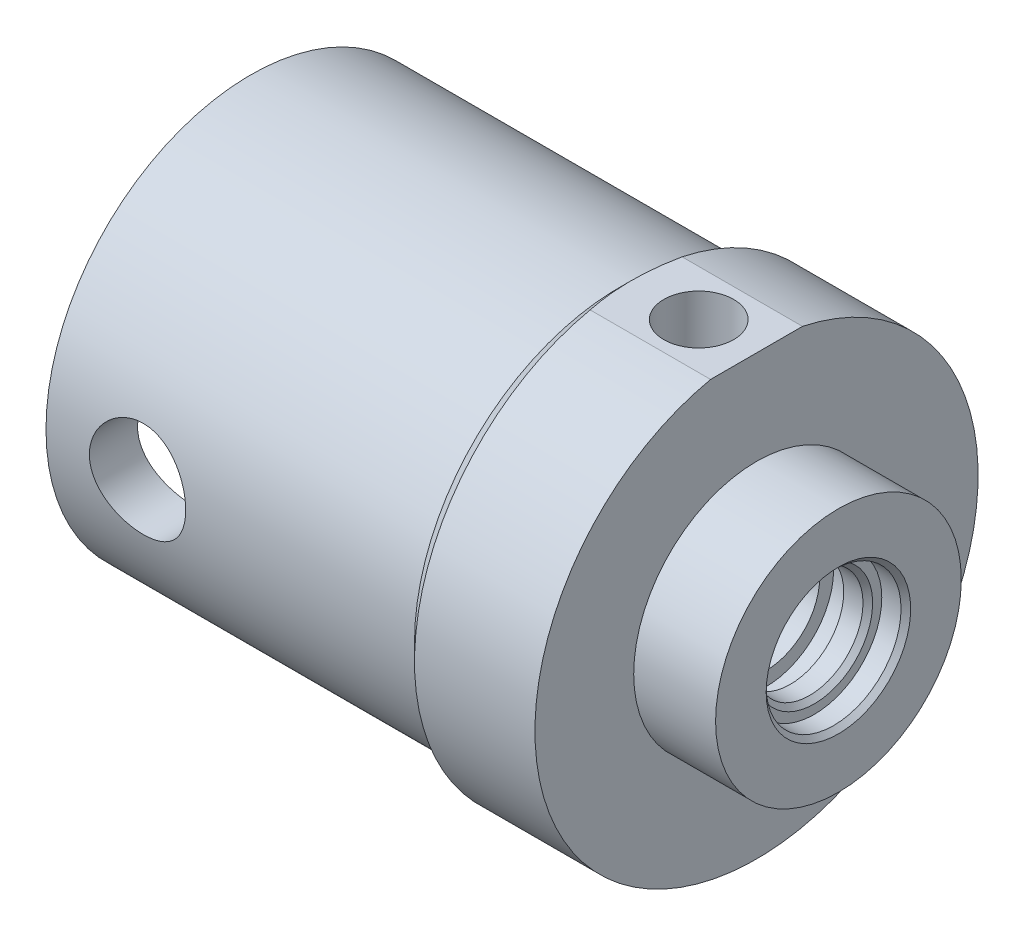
ISO-10303-21;
HEADER;
FILE_DESCRIPTION(('STEP AP214'),'2;1');
FILE_NAME('part.step','',(''),(''),'','','');
FILE_SCHEMA(('AUTOMOTIVE_DESIGN { 1 0 10303 214 1 1 1 1 }'));
ENDSEC;
DATA;
#1=APPLICATION_CONTEXT('core data for automotive mechanical design processes');
#2=APPLICATION_PROTOCOL_DEFINITION('international standard','automotive_design',2000,#1);
#3=PRODUCT_CONTEXT('',#1,'mechanical');
#4=PRODUCT('Part','Part','',(#3));
#5=PRODUCT_RELATED_PRODUCT_CATEGORY('part','',(#4));
#6=PRODUCT_DEFINITION_FORMATION('','',#4);
#7=PRODUCT_DEFINITION_CONTEXT('part definition',#1,'design');
#8=PRODUCT_DEFINITION('design','',#6,#7);
#9=PRODUCT_DEFINITION_SHAPE('','',#8);
#10=(LENGTH_UNIT() NAMED_UNIT(*) SI_UNIT(.MILLI.,.METRE.));
#11=(NAMED_UNIT(*) PLANE_ANGLE_UNIT() SI_UNIT($,.RADIAN.));
#12=(NAMED_UNIT(*) SI_UNIT($,.STERADIAN.) SOLID_ANGLE_UNIT());
#13=UNCERTAINTY_MEASURE_WITH_UNIT(LENGTH_MEASURE(1.E-05),#10,'distance_accuracy_value','');
#14=(GEOMETRIC_REPRESENTATION_CONTEXT(3) GLOBAL_UNCERTAINTY_ASSIGNED_CONTEXT((#13)) GLOBAL_UNIT_ASSIGNED_CONTEXT((#10,
#11,#12)) REPRESENTATION_CONTEXT('',''));
#15=CARTESIAN_POINT('',(0.,0.,0.));
#16=DIRECTION('',(0.,0.,1.));
#17=DIRECTION('',(1.,0.,0.));
#18=AXIS2_PLACEMENT_3D('',#15,#16,#17);
#19=CARTESIAN_POINT('',(0.,0.,0.));
#20=DIRECTION('',(1.,0.,0.));
#21=DIRECTION('',(0.,0.,-1.));
#22=AXIS2_PLACEMENT_3D('',#19,#20,#21);
#23=PLANE('',#22);
#24=CARTESIAN_POINT('',(0.,0.,0.));
#25=DIRECTION('',(1.,0.,0.));
#26=DIRECTION('',(0.,0.,-1.));
#27=AXIS2_PLACEMENT_3D('',#24,#25,#26);
#28=CIRCLE('',#27,36.);
#29=CARTESIAN_POINT('',(0.,0.,-36.));
#30=VERTEX_POINT('',#29);
#31=EDGE_CURVE('E106',#30,#30,#28,.T.);
#32=ORIENTED_EDGE('',*,*,#31,.T.);
#33=EDGE_LOOP('',(#32));
#34=FACE_BOUND('',#33,.T.);
#35=CARTESIAN_POINT('',(0.,0.,0.));
#36=DIRECTION('',(-1.,0.,0.));
#37=DIRECTION('',(0.,0.,1.));
#38=AXIS2_PLACEMENT_3D('',#35,#36,#37);
#39=CIRCLE('',#38,42.5);
#40=CARTESIAN_POINT('',(0.,0.,42.5));
#41=VERTEX_POINT('',#40);
#42=EDGE_CURVE('E109',#41,#41,#39,.T.);
#43=ORIENTED_EDGE('',*,*,#42,.T.);
#44=EDGE_LOOP('',(#43));
#45=FACE_BOUND('',#44,.T.);
#46=ADVANCED_FACE('F32',(#34,#45),#23,.F.);
#47=CARTESIAN_POINT('',(0.,0.,0.));
#48=DIRECTION('',(-1.,0.,0.));
#49=DIRECTION('',(0.,0.,1.));
#50=AXIS2_PLACEMENT_3D('',#47,#48,#49);
#51=CYLINDRICAL_SURFACE('',#50,42.5);
#52=CARTESIAN_POINT('',(29.,0.,42.5));
#53=CARTESIAN_POINT('',(29.0000073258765,-0.276858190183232,42.5000042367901));
#54=CARTESIAN_POINT('',(28.9885003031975,-0.55363278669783,42.4972904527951));
#55=CARTESIAN_POINT('',(28.9425835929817,-1.10525078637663,42.4865203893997));
#56=CARTESIAN_POINT('',(28.9081708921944,-1.38009393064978,42.4784634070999));
#57=CARTESIAN_POINT('',(28.8166927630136,-1.9259238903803,42.4572195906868));
#58=CARTESIAN_POINT('',(28.7596149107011,-2.19690850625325,42.4440299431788));
#59=CARTESIAN_POINT('',(28.6232734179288,-2.73296370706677,42.4128870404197));
#60=CARTESIAN_POINT('',(28.544009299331,-2.99803416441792,42.3949336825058));
#61=CARTESIAN_POINT('',(28.3640275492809,-3.5201053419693,42.354779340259));
#62=CARTESIAN_POINT('',(28.2633349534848,-3.77711508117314,42.3325833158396));
#63=CARTESIAN_POINT('',(28.0412076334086,-4.28165161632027,42.2845324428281));
#64=CARTESIAN_POINT('',(27.9197727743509,-4.52917835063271,42.258677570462));
#65=CARTESIAN_POINT('',(27.6570748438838,-5.01306602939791,42.2040098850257));
#66=CARTESIAN_POINT('',(27.5158157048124,-5.24942917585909,42.1751976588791));
#67=CARTESIAN_POINT('',(27.2143887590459,-5.70959717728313,42.1153696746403));
#68=CARTESIAN_POINT('',(27.054214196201,-5.93339750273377,42.0843531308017));
#69=CARTESIAN_POINT('',(26.7133526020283,-6.37041722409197,42.0204395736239));
#70=CARTESIAN_POINT('',(26.5323767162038,-6.58340811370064,41.9875203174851));
#71=CARTESIAN_POINT('',(26.1531989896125,-6.99355274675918,41.921157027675));
#72=CARTESIAN_POINT('',(25.9549893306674,-7.19069922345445,41.8877127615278));
#73=CARTESIAN_POINT('',(25.5427059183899,-7.56776353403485,41.8212340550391));
#74=CARTESIAN_POINT('',(25.3286305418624,-7.74767960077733,41.7881996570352));
#75=CARTESIAN_POINT('',(24.8861397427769,-8.08896735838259,41.7234798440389));
#76=CARTESIAN_POINT('',(24.6577308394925,-8.25034738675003,41.6917938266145));
#77=CARTESIAN_POINT('',(24.1848235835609,-8.55557501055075,41.6302379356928));
#78=CARTESIAN_POINT('',(23.9401501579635,-8.69915762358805,41.60039821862));
#79=CARTESIAN_POINT('',(23.4392971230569,-8.96509918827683,41.5438982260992));
#80=CARTESIAN_POINT('',(23.1831220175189,-9.08746635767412,41.5172367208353));
#81=CARTESIAN_POINT('',(22.6609426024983,-9.31010549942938,41.4678785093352));
#82=CARTESIAN_POINT('',(22.3949374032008,-9.41037546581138,41.4451821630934));
#83=CARTESIAN_POINT('',(21.8550326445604,-9.58798957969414,41.4044534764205));
#84=CARTESIAN_POINT('',(21.5811332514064,-9.66533420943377,41.3864210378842));
#85=CARTESIAN_POINT('',(21.0324084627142,-9.79527365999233,41.3558580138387));
#86=CARTESIAN_POINT('',(20.7576870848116,-9.84828606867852,41.343234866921));
#87=CARTESIAN_POINT('',(20.2045756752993,-9.93112239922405,41.323415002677));
#88=CARTESIAN_POINT('',(19.9261856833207,-9.96094657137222,41.3162182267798));
#89=CARTESIAN_POINT('',(19.3678316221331,-9.99714750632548,41.3074737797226));
#90=CARTESIAN_POINT('',(19.0878677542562,-10.003527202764,41.3059254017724));
#91=CARTESIAN_POINT('',(18.5284193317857,-9.99279156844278,41.3085239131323));
#92=CARTESIAN_POINT('',(18.2489347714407,-9.97567652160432,41.312670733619));
#93=CARTESIAN_POINT('',(17.6984580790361,-9.91871563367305,41.3263827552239));
#94=CARTESIAN_POINT('',(17.4274119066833,-9.87936206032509,41.3358305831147));
#95=CARTESIAN_POINT('',(16.8896793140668,-9.77861807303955,41.3597788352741));
#96=CARTESIAN_POINT('',(16.622992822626,-9.71722801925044,41.3742791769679));
#97=CARTESIAN_POINT('',(16.0958549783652,-9.57291017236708,41.4079083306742));
#98=CARTESIAN_POINT('',(15.835402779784,-9.48998531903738,41.4270365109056));
#99=CARTESIAN_POINT('',(15.3223546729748,-9.30319740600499,41.46938248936));
#100=CARTESIAN_POINT('',(15.0697617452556,-9.19932651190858,41.4926018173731));
#101=CARTESIAN_POINT('',(14.5719966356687,-8.97042315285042,41.5426930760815));
#102=CARTESIAN_POINT('',(14.3269099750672,-8.84521143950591,41.5695955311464));
#103=CARTESIAN_POINT('',(13.8481138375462,-8.57517440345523,41.6261384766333));
#104=CARTESIAN_POINT('',(13.6144048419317,-8.43034825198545,41.6557790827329));
#105=CARTESIAN_POINT('',(13.1598437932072,-8.12206868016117,41.7169832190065));
#106=CARTESIAN_POINT('',(12.9389931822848,-7.9586131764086,41.7485469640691));
#107=CARTESIAN_POINT('',(12.5115743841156,-7.61417544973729,41.8127374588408));
#108=CARTESIAN_POINT('',(12.3050064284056,-7.4331929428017,41.84536422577));
#109=CARTESIAN_POINT('',(11.902454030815,-7.05010435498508,41.9116302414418));
#110=CARTESIAN_POINT('',(11.7068672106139,-6.84758104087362,41.9452742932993));
#111=CARTESIAN_POINT('',(11.3334089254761,-6.42670469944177,42.0118179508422));
#112=CARTESIAN_POINT('',(11.1555371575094,-6.208351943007,42.0447175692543));
#113=CARTESIAN_POINT('',(10.8186928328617,-5.75721096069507,42.1088640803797));
#114=CARTESIAN_POINT('',(10.6597248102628,-5.52441929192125,42.140110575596));
#115=CARTESIAN_POINT('',(10.3619330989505,-5.04610102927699,42.2000583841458));
#116=CARTESIAN_POINT('',(10.2231016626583,-4.80057938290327,42.2287606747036));
#117=CARTESIAN_POINT('',(9.96616013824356,-4.29764052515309,42.2829094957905));
#118=CARTESIAN_POINT('',(9.84811306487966,-4.04019002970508,42.3083460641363));
#119=CARTESIAN_POINT('',(9.63417069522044,-3.51587940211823,42.3551396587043));
#120=CARTESIAN_POINT('',(9.53827550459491,-3.24901922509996,42.3764966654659));
#121=CARTESIAN_POINT('',(9.36942912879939,-2.70784720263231,42.41451549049));
#122=CARTESIAN_POINT('',(9.29647478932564,-2.43353638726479,42.4311779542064));
#123=CARTESIAN_POINT('',(9.17410840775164,-1.87945321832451,42.459328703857));
#124=CARTESIAN_POINT('',(9.12469585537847,-1.59968098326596,42.4708171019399));
#125=CARTESIAN_POINT('',(9.05069390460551,-1.04320961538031,42.4880857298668));
#126=CARTESIAN_POINT('',(9.02556344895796,-0.766586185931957,42.4939903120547));
#127=CARTESIAN_POINT('',(8.99839886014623,-0.212146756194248,42.5003746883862));
#128=CARTESIAN_POINT('',(8.99636437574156,0.0656692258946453,42.500854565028));
#129=CARTESIAN_POINT('',(9.01540781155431,0.620442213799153,42.4963762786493));
#130=CARTESIAN_POINT('',(9.03648403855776,0.89739928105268,42.4914185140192));
#131=CARTESIAN_POINT('',(9.10156844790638,1.44845684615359,42.4762044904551));
#132=CARTESIAN_POINT('',(9.14557655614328,1.72255735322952,42.4659482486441));
#133=CARTESIAN_POINT('',(9.25544181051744,2.26240585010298,42.4405890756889));
#134=CARTESIAN_POINT('',(9.32100867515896,2.52821603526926,42.4255506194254));
#135=CARTESIAN_POINT('',(9.47360891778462,3.05329689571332,42.3909967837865));
#136=CARTESIAN_POINT('',(9.56064205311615,3.31256764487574,42.3714814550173));
#137=CARTESIAN_POINT('',(9.75549978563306,3.8227980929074,42.3284982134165));
#138=CARTESIAN_POINT('',(9.86332203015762,4.07375872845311,42.3050307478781));
#139=CARTESIAN_POINT('',(10.0990165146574,4.56584596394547,42.2547542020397));
#140=CARTESIAN_POINT('',(10.2268963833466,4.80696877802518,42.2279438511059));
#141=CARTESIAN_POINT('',(10.5039334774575,5.28142955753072,42.1712518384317));
#142=CARTESIAN_POINT('',(10.6533930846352,5.51458600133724,42.1413285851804));
#143=CARTESIAN_POINT('',(10.9710617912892,5.96764034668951,42.0795623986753));
#144=CARTESIAN_POINT('',(11.1392793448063,6.18753220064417,42.0477186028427));
#145=CARTESIAN_POINT('',(11.4932972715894,6.61255758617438,41.982976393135));
#146=CARTESIAN_POINT('',(11.679099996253,6.81768913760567,41.9500778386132));
#147=CARTESIAN_POINT('',(12.0669619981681,7.21175316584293,41.8841320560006));
#148=CARTESIAN_POINT('',(12.2690141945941,7.400692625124,41.8510848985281));
#149=CARTESIAN_POINT('',(12.6927587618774,7.76521230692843,41.7850038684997));
#150=CARTESIAN_POINT('',(12.9147854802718,7.94040706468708,41.7519862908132));
#151=CARTESIAN_POINT('',(13.3729565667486,8.27141003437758,41.6876744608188));
#152=CARTESIAN_POINT('',(13.609095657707,8.42722542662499,41.6563795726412));
#153=CARTESIAN_POINT('',(14.0940154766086,8.71844690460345,41.5964036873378));
#154=CARTESIAN_POINT('',(14.3427983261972,8.85384954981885,41.5677231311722));
#155=CARTESIAN_POINT('',(14.851258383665,9.1031926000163,41.5138310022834));
#156=CARTESIAN_POINT('',(15.1109354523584,9.21713327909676,41.4886193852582));
#157=CARTESIAN_POINT('',(15.6377901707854,9.42204649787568,41.4425627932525));
#158=CARTESIAN_POINT('',(15.9049141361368,9.51315138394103,41.4216927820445));
#159=CARTESIAN_POINT('',(16.4462183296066,9.67252805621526,41.384766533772));
#160=CARTESIAN_POINT('',(16.7203985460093,9.74079988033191,41.3687102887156));
#161=CARTESIAN_POINT('',(17.2737609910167,9.85392497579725,41.3419102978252));
#162=CARTESIAN_POINT('',(17.5529424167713,9.89878197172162,41.3311657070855));
#163=CARTESIAN_POINT('',(18.1142575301,9.96470321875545,41.315322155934));
#164=CARTESIAN_POINT('',(18.3963911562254,9.98576796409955,41.3102230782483));
#165=CARTESIAN_POINT('',(18.95429570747,10.003690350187,41.3058864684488));
#166=CARTESIAN_POINT('',(19.2300463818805,10.0011488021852,41.3065034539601));
#167=CARTESIAN_POINT('',(19.7803257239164,9.97331359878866,41.3132330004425));
#168=CARTESIAN_POINT('',(20.0548544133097,9.94802035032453,41.3193454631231));
#169=CARTESIAN_POINT('',(20.6007124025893,9.87489479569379,41.3368825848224));
#170=CARTESIAN_POINT('',(20.8720417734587,9.82706299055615,41.3483071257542));
#171=CARTESIAN_POINT('',(21.4095876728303,9.70925317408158,41.3761291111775));
#172=CARTESIAN_POINT('',(21.6758041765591,9.63927505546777,41.3925265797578));
#173=CARTESIAN_POINT('',(22.1999946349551,9.47812513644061,41.4297229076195));
#174=CARTESIAN_POINT('',(22.4580024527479,9.38705834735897,41.4504999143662));
#175=CARTESIAN_POINT('',(22.9654920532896,9.18420249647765,41.4959181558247));
#176=CARTESIAN_POINT('',(23.2149707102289,9.0724059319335,41.5205607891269));
#177=CARTESIAN_POINT('',(23.7036511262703,8.82893995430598,41.5730118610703));
#178=CARTESIAN_POINT('',(23.9428539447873,8.69727259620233,41.6008199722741));
#179=CARTESIAN_POINT('',(24.4094947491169,8.41497087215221,41.6588408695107));
#180=CARTESIAN_POINT('',(24.6369322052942,8.26433565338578,41.6890537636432));
#181=CARTESIAN_POINT('',(25.083744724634,7.94139704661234,41.7517890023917));
#182=CARTESIAN_POINT('',(25.3028093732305,7.76867128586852,41.7843487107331));
#183=CARTESIAN_POINT('',(25.7256873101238,7.40559226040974,41.8502238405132));
#184=CARTESIAN_POINT('',(25.9295003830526,7.2152387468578,41.8835392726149));
#185=CARTESIAN_POINT('',(26.3205837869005,6.81811798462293,41.9500154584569));
#186=CARTESIAN_POINT('',(26.5078501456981,6.61134681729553,41.9831761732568));
#187=CARTESIAN_POINT('',(26.8645296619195,6.18279008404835,42.0484253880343));
#188=CARTESIAN_POINT('',(27.0339432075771,5.96100484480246,42.0805139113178));
#189=CARTESIAN_POINT('',(27.3562848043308,5.50025358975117,42.1432331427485));
#190=CARTESIAN_POINT('',(27.5089105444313,5.26107169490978,42.1738328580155));
#191=CARTESIAN_POINT('',(27.7933704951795,4.77043222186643,42.2321439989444));
#192=CARTESIAN_POINT('',(27.9252123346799,4.51897919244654,42.2598564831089));
#193=CARTESIAN_POINT('',(28.1671068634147,4.00557276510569,42.3116045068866));
#194=CARTESIAN_POINT('',(28.2771701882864,3.74362456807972,42.3356418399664));
#195=CARTESIAN_POINT('',(28.4746862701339,3.21107739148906,42.3793634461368));
#196=CARTESIAN_POINT('',(28.5621427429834,2.94047984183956,42.3990484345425));
#197=CARTESIAN_POINT('',(28.7577168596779,2.23349664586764,42.4434817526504));
#198=CARTESIAN_POINT('',(28.8484265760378,1.79192985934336,42.4645511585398));
#199=CARTESIAN_POINT('',(28.9695604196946,0.900168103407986,42.4928064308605));
#200=CARTESIAN_POINT('',(28.9999880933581,0.449973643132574,42.4999931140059));
#201=CARTESIAN_POINT('',(29.,0.,42.5));
#202=B_SPLINE_CURVE_WITH_KNOTS('',3,(#52,#53,#54,#55,#56,#57,#58,#59,#60,#61,#62,#63,#64,#65,
#66,#67,#68,#69,#70,#71,#72,#73,#74,#75,#76,#77,#78,#79,#80,#81,#82,#83,#84,#85,#86,#87,#88,#89,
#90,#91,#92,#93,#94,#95,#96,#97,#98,#99,#100,#101,#102,#103,#104,#105,#106,#107,#108,#109,#110,
#111,#112,#113,#114,#115,#116,#117,#118,#119,#120,#121,#122,#123,#124,#125,#126,#127,#128,#129,
#130,#131,#132,#133,#134,#135,#136,#137,#138,#139,#140,#141,#142,#143,#144,#145,#146,#147,#148,
#149,#150,#151,#152,#153,#154,#155,#156,#157,#158,#159,#160,#161,#162,#163,#164,#165,#166,#167,
#168,#169,#170,#171,#172,#173,#174,#175,#176,#177,#178,#179,#180,#181,#182,#183,#184,#185,#186,
#187,#188,#189,#190,#191,#192,#193,#194,#195,#196,#197,#198,#199,#200,#201),.UNSPECIFIED.,.T.,
.F.,(4,2,2,2,2,2,2,2,2,2,2,2,2,2,2,2,2,2,2,2,2,2,2,2,2,2,2,2,2,2,2,2,2,2,2,2,2,2,2,2,2,2,2,2,2,
2,2,2,2,2,2,2,2,2,2,2,2,2,2,2,2,2,2,2,2,2,2,2,2,2,2,2,2,2,4),(0.,0.830178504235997,
1.66046624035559,2.49120972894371,3.32197112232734,4.15176718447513,4.98156863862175,
5.81120572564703,6.6411400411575,7.4844429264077,8.32813039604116,9.17190430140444,
10.0152971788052,10.870032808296,11.7244366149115,12.5789179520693,13.4333813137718,
14.2725751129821,15.1117598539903,15.9508395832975,16.7899091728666,17.6110945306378,
18.4322664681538,19.253326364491,20.0746939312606,20.9033350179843,21.732011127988,
22.5607800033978,23.3895623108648,24.2392195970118,25.0888623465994,25.9387084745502,
26.788226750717,27.640277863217,28.4923330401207,29.344271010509,30.1961905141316,
31.0286569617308,31.8611107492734,32.6935035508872,33.525893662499,34.3475059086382,
35.1691088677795,35.9906189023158,36.812442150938,37.6471608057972,38.482257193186,
39.3174654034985,40.1523116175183,41.0055288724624,41.858429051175,42.71147282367,
43.5645057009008,44.4124740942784,45.2604410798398,46.1082731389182,46.9560875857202,
47.7823843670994,48.6086663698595,49.4349300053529,50.261197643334,51.0834361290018,
51.905972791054,52.7284244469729,53.5509130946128,54.3925254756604,55.2341497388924,
56.0759754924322,56.9177829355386,57.772873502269,58.6276494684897,59.4820069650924,
60.336223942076,61.6855805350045,63.0348577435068),.UNSPECIFIED.);
#203=CARTESIAN_POINT('',(29.,0.,42.5));
#204=VERTEX_POINT('',#203);
#205=EDGE_CURVE('E190',#204,#204,#202,.T.);
#206=ORIENTED_EDGE('',*,*,#205,.T.);
#207=EDGE_LOOP('',(#206));
#208=FACE_BOUND('',#207,.T.);
#209=CARTESIAN_POINT('',(29.,0.,-42.5));
#210=CARTESIAN_POINT('',(29.0000073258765,0.276858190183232,-42.5000042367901));
#211=CARTESIAN_POINT('',(28.9885003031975,0.55363278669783,-42.4972904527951));
#212=CARTESIAN_POINT('',(28.9425835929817,1.10525078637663,-42.4865203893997));
#213=CARTESIAN_POINT('',(28.9081708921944,1.38009393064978,-42.4784634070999));
#214=CARTESIAN_POINT('',(28.8166927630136,1.9259238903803,-42.4572195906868));
#215=CARTESIAN_POINT('',(28.7596149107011,2.19690850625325,-42.4440299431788));
#216=CARTESIAN_POINT('',(28.6232734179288,2.73296370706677,-42.4128870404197));
#217=CARTESIAN_POINT('',(28.544009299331,2.99803416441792,-42.3949336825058));
#218=CARTESIAN_POINT('',(28.3640275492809,3.5201053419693,-42.354779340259));
#219=CARTESIAN_POINT('',(28.2633349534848,3.77711508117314,-42.3325833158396));
#220=CARTESIAN_POINT('',(28.0412076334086,4.28165161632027,-42.2845324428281));
#221=CARTESIAN_POINT('',(27.9197727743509,4.52917835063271,-42.258677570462));
#222=CARTESIAN_POINT('',(27.6570748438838,5.01306602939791,-42.2040098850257));
#223=CARTESIAN_POINT('',(27.5158157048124,5.24942917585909,-42.1751976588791));
#224=CARTESIAN_POINT('',(27.2143887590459,5.70959717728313,-42.1153696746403));
#225=CARTESIAN_POINT('',(27.054214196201,5.93339750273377,-42.0843531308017));
#226=CARTESIAN_POINT('',(26.7133526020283,6.37041722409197,-42.0204395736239));
#227=CARTESIAN_POINT('',(26.5323767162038,6.58340811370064,-41.9875203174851));
#228=CARTESIAN_POINT('',(26.1531989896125,6.99355274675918,-41.921157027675));
#229=CARTESIAN_POINT('',(25.9549893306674,7.19069922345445,-41.8877127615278));
#230=CARTESIAN_POINT('',(25.5427059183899,7.56776353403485,-41.8212340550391));
#231=CARTESIAN_POINT('',(25.3286305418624,7.74767960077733,-41.7881996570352));
#232=CARTESIAN_POINT('',(24.8861397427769,8.08896735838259,-41.7234798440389));
#233=CARTESIAN_POINT('',(24.6577308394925,8.25034738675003,-41.6917938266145));
#234=CARTESIAN_POINT('',(24.1848235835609,8.55557501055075,-41.6302379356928));
#235=CARTESIAN_POINT('',(23.9401501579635,8.69915762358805,-41.60039821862));
#236=CARTESIAN_POINT('',(23.4392971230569,8.96509918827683,-41.5438982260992));
#237=CARTESIAN_POINT('',(23.1831220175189,9.08746635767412,-41.5172367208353));
#238=CARTESIAN_POINT('',(22.6609426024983,9.31010549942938,-41.4678785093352));
#239=CARTESIAN_POINT('',(22.3949374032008,9.41037546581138,-41.4451821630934));
#240=CARTESIAN_POINT('',(21.8550326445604,9.58798957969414,-41.4044534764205));
#241=CARTESIAN_POINT('',(21.5811332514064,9.66533420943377,-41.3864210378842));
#242=CARTESIAN_POINT('',(21.0324084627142,9.79527365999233,-41.3558580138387));
#243=CARTESIAN_POINT('',(20.7576870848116,9.84828606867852,-41.343234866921));
#244=CARTESIAN_POINT('',(20.2045756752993,9.93112239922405,-41.323415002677));
#245=CARTESIAN_POINT('',(19.9261856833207,9.96094657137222,-41.3162182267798));
#246=CARTESIAN_POINT('',(19.3678316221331,9.99714750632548,-41.3074737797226));
#247=CARTESIAN_POINT('',(19.0878677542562,10.003527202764,-41.3059254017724));
#248=CARTESIAN_POINT('',(18.5284193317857,9.99279156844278,-41.3085239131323));
#249=CARTESIAN_POINT('',(18.2489347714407,9.97567652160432,-41.312670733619));
#250=CARTESIAN_POINT('',(17.6984580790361,9.91871563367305,-41.3263827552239));
#251=CARTESIAN_POINT('',(17.4274119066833,9.87936206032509,-41.3358305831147));
#252=CARTESIAN_POINT('',(16.8896793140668,9.77861807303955,-41.3597788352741));
#253=CARTESIAN_POINT('',(16.622992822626,9.71722801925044,-41.3742791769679));
#254=CARTESIAN_POINT('',(16.0958549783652,9.57291017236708,-41.4079083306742));
#255=CARTESIAN_POINT('',(15.835402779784,9.48998531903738,-41.4270365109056));
#256=CARTESIAN_POINT('',(15.3223546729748,9.30319740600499,-41.46938248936));
#257=CARTESIAN_POINT('',(15.0697617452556,9.19932651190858,-41.4926018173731));
#258=CARTESIAN_POINT('',(14.5719966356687,8.97042315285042,-41.5426930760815));
#259=CARTESIAN_POINT('',(14.3269099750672,8.84521143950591,-41.5695955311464));
#260=CARTESIAN_POINT('',(13.8481138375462,8.57517440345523,-41.6261384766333));
#261=CARTESIAN_POINT('',(13.6144048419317,8.43034825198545,-41.6557790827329));
#262=CARTESIAN_POINT('',(13.1598437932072,8.12206868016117,-41.7169832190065));
#263=CARTESIAN_POINT('',(12.9389931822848,7.9586131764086,-41.7485469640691));
#264=CARTESIAN_POINT('',(12.5115743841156,7.61417544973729,-41.8127374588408));
#265=CARTESIAN_POINT('',(12.3050064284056,7.4331929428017,-41.84536422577));
#266=CARTESIAN_POINT('',(11.902454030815,7.05010435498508,-41.9116302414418));
#267=CARTESIAN_POINT('',(11.7068672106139,6.84758104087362,-41.9452742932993));
#268=CARTESIAN_POINT('',(11.3334089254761,6.42670469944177,-42.0118179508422));
#269=CARTESIAN_POINT('',(11.1555371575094,6.208351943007,-42.0447175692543));
#270=CARTESIAN_POINT('',(10.8186928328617,5.75721096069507,-42.1088640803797));
#271=CARTESIAN_POINT('',(10.6597248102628,5.52441929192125,-42.140110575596));
#272=CARTESIAN_POINT('',(10.3619330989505,5.04610102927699,-42.2000583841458));
#273=CARTESIAN_POINT('',(10.2231016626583,4.80057938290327,-42.2287606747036));
#274=CARTESIAN_POINT('',(9.96616013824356,4.29764052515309,-42.2829094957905));
#275=CARTESIAN_POINT('',(9.84811306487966,4.04019002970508,-42.3083460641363));
#276=CARTESIAN_POINT('',(9.63417069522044,3.51587940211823,-42.3551396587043));
#277=CARTESIAN_POINT('',(9.53827550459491,3.24901922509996,-42.3764966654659));
#278=CARTESIAN_POINT('',(9.36942912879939,2.70784720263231,-42.41451549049));
#279=CARTESIAN_POINT('',(9.29647478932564,2.43353638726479,-42.4311779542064));
#280=CARTESIAN_POINT('',(9.17410840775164,1.87945321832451,-42.459328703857));
#281=CARTESIAN_POINT('',(9.12469585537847,1.59968098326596,-42.4708171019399));
#282=CARTESIAN_POINT('',(9.05069390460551,1.04320961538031,-42.4880857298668));
#283=CARTESIAN_POINT('',(9.02556344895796,0.766586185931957,-42.4939903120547));
#284=CARTESIAN_POINT('',(8.99839886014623,0.212146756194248,-42.5003746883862));
#285=CARTESIAN_POINT('',(8.99636437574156,-0.0656692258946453,-42.500854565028));
#286=CARTESIAN_POINT('',(9.01540781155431,-0.620442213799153,-42.4963762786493));
#287=CARTESIAN_POINT('',(9.03648403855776,-0.89739928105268,-42.4914185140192));
#288=CARTESIAN_POINT('',(9.10156844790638,-1.44845684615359,-42.4762044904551));
#289=CARTESIAN_POINT('',(9.14557655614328,-1.72255735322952,-42.4659482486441));
#290=CARTESIAN_POINT('',(9.25544181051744,-2.26240585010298,-42.4405890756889));
#291=CARTESIAN_POINT('',(9.32100867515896,-2.52821603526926,-42.4255506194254));
#292=CARTESIAN_POINT('',(9.47360891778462,-3.05329689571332,-42.3909967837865));
#293=CARTESIAN_POINT('',(9.56064205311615,-3.31256764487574,-42.3714814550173));
#294=CARTESIAN_POINT('',(9.75549978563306,-3.8227980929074,-42.3284982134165));
#295=CARTESIAN_POINT('',(9.86332203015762,-4.07375872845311,-42.3050307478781));
#296=CARTESIAN_POINT('',(10.0990165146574,-4.56584596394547,-42.2547542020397));
#297=CARTESIAN_POINT('',(10.2268963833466,-4.80696877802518,-42.2279438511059));
#298=CARTESIAN_POINT('',(10.5039334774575,-5.28142955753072,-42.1712518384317));
#299=CARTESIAN_POINT('',(10.6533930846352,-5.51458600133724,-42.1413285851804));
#300=CARTESIAN_POINT('',(10.9710617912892,-5.96764034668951,-42.0795623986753));
#301=CARTESIAN_POINT('',(11.1392793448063,-6.18753220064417,-42.0477186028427));
#302=CARTESIAN_POINT('',(11.4932972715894,-6.61255758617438,-41.982976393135));
#303=CARTESIAN_POINT('',(11.679099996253,-6.81768913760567,-41.9500778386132));
#304=CARTESIAN_POINT('',(12.0669619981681,-7.21175316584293,-41.8841320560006));
#305=CARTESIAN_POINT('',(12.2690141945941,-7.400692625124,-41.8510848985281));
#306=CARTESIAN_POINT('',(12.6927587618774,-7.76521230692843,-41.7850038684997));
#307=CARTESIAN_POINT('',(12.9147854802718,-7.94040706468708,-41.7519862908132));
#308=CARTESIAN_POINT('',(13.3729565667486,-8.27141003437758,-41.6876744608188));
#309=CARTESIAN_POINT('',(13.609095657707,-8.42722542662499,-41.6563795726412));
#310=CARTESIAN_POINT('',(14.0940154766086,-8.71844690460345,-41.5964036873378));
#311=CARTESIAN_POINT('',(14.3427983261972,-8.85384954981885,-41.5677231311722));
#312=CARTESIAN_POINT('',(14.851258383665,-9.1031926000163,-41.5138310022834));
#313=CARTESIAN_POINT('',(15.1109354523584,-9.21713327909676,-41.4886193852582));
#314=CARTESIAN_POINT('',(15.6377901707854,-9.42204649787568,-41.4425627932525));
#315=CARTESIAN_POINT('',(15.9049141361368,-9.51315138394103,-41.4216927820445));
#316=CARTESIAN_POINT('',(16.4462183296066,-9.67252805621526,-41.384766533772));
#317=CARTESIAN_POINT('',(16.7203985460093,-9.74079988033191,-41.3687102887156));
#318=CARTESIAN_POINT('',(17.2737609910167,-9.85392497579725,-41.3419102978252));
#319=CARTESIAN_POINT('',(17.5529424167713,-9.89878197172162,-41.3311657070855));
#320=CARTESIAN_POINT('',(18.1142575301,-9.96470321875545,-41.315322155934));
#321=CARTESIAN_POINT('',(18.3963911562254,-9.98576796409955,-41.3102230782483));
#322=CARTESIAN_POINT('',(18.95429570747,-10.003690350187,-41.3058864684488));
#323=CARTESIAN_POINT('',(19.2300463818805,-10.0011488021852,-41.3065034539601));
#324=CARTESIAN_POINT('',(19.7803257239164,-9.97331359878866,-41.3132330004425));
#325=CARTESIAN_POINT('',(20.0548544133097,-9.94802035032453,-41.3193454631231));
#326=CARTESIAN_POINT('',(20.6007124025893,-9.87489479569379,-41.3368825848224));
#327=CARTESIAN_POINT('',(20.8720417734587,-9.82706299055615,-41.3483071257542));
#328=CARTESIAN_POINT('',(21.4095876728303,-9.70925317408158,-41.3761291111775));
#329=CARTESIAN_POINT('',(21.6758041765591,-9.63927505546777,-41.3925265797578));
#330=CARTESIAN_POINT('',(22.1999946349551,-9.47812513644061,-41.4297229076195));
#331=CARTESIAN_POINT('',(22.4580024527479,-9.38705834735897,-41.4504999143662));
#332=CARTESIAN_POINT('',(22.9654920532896,-9.18420249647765,-41.4959181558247));
#333=CARTESIAN_POINT('',(23.2149707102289,-9.0724059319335,-41.5205607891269));
#334=CARTESIAN_POINT('',(23.7036511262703,-8.82893995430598,-41.5730118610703));
#335=CARTESIAN_POINT('',(23.9428539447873,-8.69727259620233,-41.6008199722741));
#336=CARTESIAN_POINT('',(24.4094947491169,-8.41497087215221,-41.6588408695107));
#337=CARTESIAN_POINT('',(24.6369322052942,-8.26433565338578,-41.6890537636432));
#338=CARTESIAN_POINT('',(25.083744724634,-7.94139704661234,-41.7517890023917));
#339=CARTESIAN_POINT('',(25.3028093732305,-7.76867128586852,-41.7843487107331));
#340=CARTESIAN_POINT('',(25.7256873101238,-7.40559226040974,-41.8502238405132));
#341=CARTESIAN_POINT('',(25.9295003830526,-7.2152387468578,-41.8835392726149));
#342=CARTESIAN_POINT('',(26.3205837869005,-6.81811798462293,-41.9500154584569));
#343=CARTESIAN_POINT('',(26.5078501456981,-6.61134681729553,-41.9831761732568));
#344=CARTESIAN_POINT('',(26.8645296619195,-6.18279008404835,-42.0484253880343));
#345=CARTESIAN_POINT('',(27.0339432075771,-5.96100484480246,-42.0805139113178));
#346=CARTESIAN_POINT('',(27.3562848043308,-5.50025358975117,-42.1432331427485));
#347=CARTESIAN_POINT('',(27.5089105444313,-5.26107169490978,-42.1738328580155));
#348=CARTESIAN_POINT('',(27.7933704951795,-4.77043222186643,-42.2321439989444));
#349=CARTESIAN_POINT('',(27.9252123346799,-4.51897919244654,-42.2598564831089));
#350=CARTESIAN_POINT('',(28.1671068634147,-4.00557276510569,-42.3116045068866));
#351=CARTESIAN_POINT('',(28.2771701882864,-3.74362456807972,-42.3356418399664));
#352=CARTESIAN_POINT('',(28.4746862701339,-3.21107739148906,-42.3793634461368));
#353=CARTESIAN_POINT('',(28.5621427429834,-2.94047984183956,-42.3990484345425));
#354=CARTESIAN_POINT('',(28.7577168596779,-2.23349664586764,-42.4434817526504));
#355=CARTESIAN_POINT('',(28.8484265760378,-1.79192985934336,-42.4645511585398));
#356=CARTESIAN_POINT('',(28.9695604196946,-0.900168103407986,-42.4928064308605));
#357=CARTESIAN_POINT('',(28.9999880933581,-0.449973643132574,-42.4999931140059));
#358=CARTESIAN_POINT('',(29.,0.,-42.5));
#359=B_SPLINE_CURVE_WITH_KNOTS('',3,(#209,#210,#211,#212,#213,#214,#215,#216,#217,#218,#219,
#220,#221,#222,#223,#224,#225,#226,#227,#228,#229,#230,#231,#232,#233,#234,#235,#236,#237,#238,
#239,#240,#241,#242,#243,#244,#245,#246,#247,#248,#249,#250,#251,#252,#253,#254,#255,#256,#257,
#258,#259,#260,#261,#262,#263,#264,#265,#266,#267,#268,#269,#270,#271,#272,#273,#274,#275,#276,
#277,#278,#279,#280,#281,#282,#283,#284,#285,#286,#287,#288,#289,#290,#291,#292,#293,#294,#295,
#296,#297,#298,#299,#300,#301,#302,#303,#304,#305,#306,#307,#308,#309,#310,#311,#312,#313,#314,
#315,#316,#317,#318,#319,#320,#321,#322,#323,#324,#325,#326,#327,#328,#329,#330,#331,#332,#333,
#334,#335,#336,#337,#338,#339,#340,#341,#342,#343,#344,#345,#346,#347,#348,#349,#350,#351,#352,
#353,#354,#355,#356,#357,#358),.UNSPECIFIED.,.T.,.F.,(4,2,2,2,2,2,2,2,2,2,2,2,2,2,2,2,2,2,2,2,2,
2,2,2,2,2,2,2,2,2,2,2,2,2,2,2,2,2,2,2,2,2,2,2,2,2,2,2,2,2,2,2,2,2,2,2,2,2,2,2,2,2,2,2,2,2,2,2,2,
2,2,2,2,2,4),(0.,0.830178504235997,1.66046624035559,2.49120972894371,3.32197112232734,
4.15176718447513,4.98156863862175,5.81120572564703,6.6411400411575,7.4844429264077,
8.32813039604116,9.17190430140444,10.0152971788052,10.870032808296,11.7244366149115,
12.5789179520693,13.4333813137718,14.2725751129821,15.1117598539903,15.9508395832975,
16.7899091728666,17.6110945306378,18.4322664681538,19.253326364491,20.0746939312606,
20.9033350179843,21.732011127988,22.5607800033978,23.3895623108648,24.2392195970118,
25.0888623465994,25.9387084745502,26.788226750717,27.640277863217,28.4923330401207,
29.344271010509,30.1961905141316,31.0286569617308,31.8611107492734,32.6935035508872,
33.525893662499,34.3475059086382,35.1691088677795,35.9906189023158,36.812442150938,
37.6471608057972,38.482257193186,39.3174654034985,40.1523116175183,41.0055288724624,
41.858429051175,42.71147282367,43.5645057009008,44.4124740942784,45.2604410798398,
46.1082731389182,46.9560875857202,47.7823843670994,48.6086663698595,49.4349300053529,
50.261197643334,51.0834361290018,51.905972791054,52.7284244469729,53.5509130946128,
54.3925254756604,55.2341497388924,56.0759754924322,56.9177829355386,57.772873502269,
58.6276494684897,59.4820069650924,60.336223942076,61.6855805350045,63.0348577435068),.UNSPECIFIED.);
#360=CARTESIAN_POINT('',(29.,0.,-42.5));
#361=VERTEX_POINT('',#360);
#362=EDGE_CURVE('E186',#361,#361,#359,.T.);
#363=ORIENTED_EDGE('',*,*,#362,.T.);
#364=EDGE_LOOP('',(#363));
#365=FACE_BOUND('',#364,.T.);
#366=ORIENTED_EDGE('',*,*,#42,.F.);
#367=EDGE_LOOP('',(#366));
#368=FACE_BOUND('',#367,.T.);
#369=CARTESIAN_POINT('',(76.5,0.,0.));
#370=DIRECTION('',(-1.,0.,0.));
#371=DIRECTION('',(0.,0.,1.));
#372=AXIS2_PLACEMENT_3D('',#369,#370,#371);
#373=CIRCLE('',#372,42.5);
#374=CARTESIAN_POINT('',(76.5,0.,42.5));
#375=VERTEX_POINT('',#374);
#376=EDGE_CURVE('E112',#375,#375,#373,.T.);
#377=ORIENTED_EDGE('',*,*,#376,.T.);
#378=EDGE_LOOP('',(#377));
#379=FACE_BOUND('',#378,.T.);
#380=ADVANCED_FACE('F96',(#208,#365,#368,#379),#51,.T.);
#381=CARTESIAN_POINT('',(80.,0.,0.));
#382=DIRECTION('',(1.,0.,0.));
#383=DIRECTION('',(0.,0.,-1.));
#384=AXIS2_PLACEMENT_3D('',#381,#382,#383);
#385=CONICAL_SURFACE('',#384,46.,0.785398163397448);
#386=ORIENTED_EDGE('',*,*,#376,.F.);
#387=EDGE_LOOP('',(#386));
#388=FACE_BOUND('',#387,.T.);
#389=CARTESIAN_POINT('',(80.,0.,0.));
#390=DIRECTION('',(-1.,0.,0.));
#391=DIRECTION('',(0.,0.,1.));
#392=AXIS2_PLACEMENT_3D('',#389,#390,#391);
#393=CIRCLE('',#392,46.);
#394=CARTESIAN_POINT('',(80.,45.,-9.53939201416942));
#395=VERTEX_POINT('',#394);
#396=CARTESIAN_POINT('',(80.,45.,9.53939201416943));
#397=VERTEX_POINT('',#396);
#398=EDGE_CURVE('E118',#395,#397,#393,.T.);
#399=ORIENTED_EDGE('',*,*,#398,.T.);
#400=CARTESIAN_POINT('',(88.9925690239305,45.,-31.6098504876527));
#401=CARTESIAN_POINT('',(88.5313033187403,45.,-30.8072660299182));
#402=CARTESIAN_POINT('',(88.0787550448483,45.,-29.9995893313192));
#403=CARTESIAN_POINT('',(87.1936557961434,45.,-28.373093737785));
#404=CARTESIAN_POINT('',(86.7611100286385,45.,-27.5542720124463));
#405=CARTESIAN_POINT('',(85.9171490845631,45.,-25.9016718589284));
#406=CARTESIAN_POINT('',(85.5058245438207,45.,-25.0678469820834));
#407=CARTESIAN_POINT('',(84.7093910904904,45.,-23.3878060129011));
#408=CARTESIAN_POINT('',(84.3242803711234,45.,-22.5415907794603));
#409=CARTESIAN_POINT('',(83.5781967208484,45.,-20.8231998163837));
#410=CARTESIAN_POINT('',(83.2176805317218,45.,-19.9508249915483));
#411=CARTESIAN_POINT('',(82.5315453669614,45.,-18.1924727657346));
#412=CARTESIAN_POINT('',(82.2059240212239,45.,-17.3064962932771));
#413=CARTESIAN_POINT('',(81.5945309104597,45.,-15.5222589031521));
#414=CARTESIAN_POINT('',(81.3087018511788,45.,-14.6240177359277));
#415=CARTESIAN_POINT('',(80.7810941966,45.,-12.8148182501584));
#416=CARTESIAN_POINT('',(80.5393089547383,45.,-11.9038618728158));
#417=CARTESIAN_POINT('',(80.0562722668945,45.,-9.86721863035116));
#418=CARTESIAN_POINT('',(79.8269819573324,45.,-8.73862811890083));
#419=CARTESIAN_POINT('',(79.5432630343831,45.,-7.03582383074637));
#420=CARTESIAN_POINT('',(79.4587192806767,45.,-6.46649682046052));
#421=CARTESIAN_POINT('',(79.3104544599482,45.,-5.3251485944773));
#422=CARTESIAN_POINT('',(79.2467318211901,45.,-4.75312758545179));
#423=CARTESIAN_POINT('',(79.1411610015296,45.,-3.61175074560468));
#424=CARTESIAN_POINT('',(79.0991396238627,45.,-3.04241091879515));
#425=CARTESIAN_POINT('',(79.0366060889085,45.,-1.90255168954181));
#426=CARTESIAN_POINT('',(79.0160937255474,45.,-1.33203229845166));
#427=CARTESIAN_POINT('',(78.9967855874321,45.,-0.19061086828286));
#428=CARTESIAN_POINT('',(78.9979903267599,45.,0.380291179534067));
#429=CARTESIAN_POINT('',(79.0221037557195,45.,1.52163905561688));
#430=CARTESIAN_POINT('',(79.04501275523,45.,2.09208487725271));
#431=CARTESIAN_POINT('',(79.1173938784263,45.,3.31780692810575));
#432=CARTESIAN_POINT('',(79.1703561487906,45.,3.97287929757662));
#433=CARTESIAN_POINT('',(79.3040553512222,45.,5.28018161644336));
#434=CARTESIAN_POINT('',(79.384793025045,45.,5.93241148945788));
#435=CARTESIAN_POINT('',(79.5730525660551,45.,7.23306133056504));
#436=CARTESIAN_POINT('',(79.6805772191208,45.,7.8814808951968));
#437=CARTESIAN_POINT('',(79.9211437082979,45.,9.17358512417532));
#438=CARTESIAN_POINT('',(80.0541882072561,45.,9.8172692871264));
#439=CARTESIAN_POINT('',(80.4930343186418,45.,11.7557662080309));
#440=CARTESIAN_POINT('',(80.8362209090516,45.,13.0423090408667));
#441=CARTESIAN_POINT('',(81.4150993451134,45.,14.9519358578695));
#442=CARTESIAN_POINT('',(81.6187298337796,45.,15.5850816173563));
#443=CARTESIAN_POINT('',(82.0457500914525,45.,16.8447305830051));
#444=CARTESIAN_POINT('',(82.2691404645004,45.,17.4712335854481));
#445=CARTESIAN_POINT('',(82.8079209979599,45.,18.9154356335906));
#446=CARTESIAN_POINT('',(83.1299913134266,45.,19.7306399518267));
#447=CARTESIAN_POINT('',(83.8021644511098,45.,21.3494214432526));
#448=CARTESIAN_POINT('',(84.1522690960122,45.,22.1529978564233));
#449=CARTESIAN_POINT('',(84.8774966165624,45.,23.7492195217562));
#450=CARTESIAN_POINT('',(85.252631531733,45.,24.5418592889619));
#451=CARTESIAN_POINT('',(86.0248983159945,45.,26.1162908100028));
#452=CARTESIAN_POINT('',(86.4220295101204,45.,26.898082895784));
#453=CARTESIAN_POINT('',(87.2372145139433,45.,28.4542057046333));
#454=CARTESIAN_POINT('',(87.6553377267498,45.,29.2284999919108));
#455=CARTESIAN_POINT('',(88.5089509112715,45.,30.7674443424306));
#456=CARTESIAN_POINT('',(88.9444410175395,45.,31.5320943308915));
#457=CARTESIAN_POINT('',(89.8307212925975,45.,33.0522426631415));
#458=CARTESIAN_POINT('',(90.2815081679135,45.,33.8077429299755));
#459=CARTESIAN_POINT('',(91.1967570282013,45.,35.3103926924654));
#460=CARTESIAN_POINT('',(91.6612189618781,45.,36.0575422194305));
#461=CARTESIAN_POINT('',(93.0279976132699,45.,38.2165842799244));
#462=CARTESIAN_POINT('',(93.9463037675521,45.,39.6183685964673));
#463=CARTESIAN_POINT('',(95.8185572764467,45.,42.3979796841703));
#464=CARTESIAN_POINT('',(96.7725075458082,45.,43.7758044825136));
#465=CARTESIAN_POINT('',(98.2210507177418,45.,45.821083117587));
#466=CARTESIAN_POINT('',(98.7046708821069,45.,46.4963444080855));
#467=CARTESIAN_POINT('',(99.6784299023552,45.,47.842157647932));
#468=CARTESIAN_POINT('',(100.168568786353,45.,48.5127095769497));
#469=CARTESIAN_POINT('',(101.15463638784,45.,49.8492598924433));
#470=CARTESIAN_POINT('',(101.650563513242,45.,50.5152594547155));
#471=CARTESIAN_POINT('',(102.64782324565,45.,51.8431805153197));
#472=CARTESIAN_POINT('',(103.149155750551,45.,52.5051020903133));
#473=CARTESIAN_POINT('',(103.652943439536,45.,53.1651439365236));
#474=B_SPLINE_CURVE_WITH_KNOTS('',3,(#400,#401,#402,#403,#404,#405,#406,#407,#408,#409,#410,
#411,#412,#413,#414,#415,#416,#417,#418,#419,#420,#421,#422,#423,#424,#425,#426,#427,#428,#429,
#430,#431,#432,#433,#434,#435,#436,#437,#438,#439,#440,#441,#442,#443,#444,#445,#446,#447,#448,
#449,#450,#451,#452,#453,#454,#455,#456,#457,#458,#459,#460,#461,#462,#463,#464,#465,#466,#467,
#468,#469,#470,#471,#472,#473),.UNSPECIFIED.,.F.,.F.,(4,2,2,2,2,2,2,2,2,2,2,2,2,2,2,2,2,2,2,2,2,
2,2,2,2,2,2,2,2,2,2,2,2,2,2,2,4),(0.,2.77713023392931,5.55497942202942,8.34384876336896,
11.1325256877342,13.9636582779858,16.7945984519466,19.6214194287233,22.4478134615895,
25.8997382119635,27.6261364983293,29.3524044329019,31.0646734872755,32.7769261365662,
34.4892193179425,36.2015369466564,38.1725420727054,40.1435998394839,42.1148626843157,
44.0863313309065,48.0768020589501,50.0718328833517,52.0669247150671,54.6958832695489,
57.3250128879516,59.9554163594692,62.585739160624,65.2254188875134,67.8651190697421,
70.5042544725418,73.1433799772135,78.1700175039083,83.1970669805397,85.6887807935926,
88.1805053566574,90.6715599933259,93.1625676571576),.UNSPECIFIED.);
#475=EDGE_CURVE('E168',#397,#395,#474,.F.);
#476=ORIENTED_EDGE('',*,*,#475,.T.);
#477=EDGE_LOOP('',(#399,#476));
#478=FACE_BOUND('',#477,.T.);
#479=ADVANCED_FACE('F101',(#388,#478),#385,.T.);
#480=CARTESIAN_POINT('',(0.,0.,0.));
#481=DIRECTION('',(-1.,0.,0.));
#482=DIRECTION('',(0.,0.,1.));
#483=AXIS2_PLACEMENT_3D('',#480,#481,#482);
#484=CYLINDRICAL_SURFACE('',#483,46.);
#485=CARTESIAN_POINT('',(105.,0.,0.));
#486=DIRECTION('',(-1.,0.,0.));
#487=DIRECTION('',(0.,0.,1.));
#488=AXIS2_PLACEMENT_3D('',#485,#486,#487);
#489=CIRCLE('',#488,46.);
#490=CARTESIAN_POINT('',(105.,45.,-9.53939201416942));
#491=VERTEX_POINT('',#490);
#492=CARTESIAN_POINT('',(105.,45.,9.53939201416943));
#493=VERTEX_POINT('',#492);
#494=EDGE_CURVE('E220',#491,#493,#489,.T.);
#495=ORIENTED_EDGE('',*,*,#494,.T.);
#496=DIRECTION('',(-1.,0.,0.));
#497=VECTOR('',#496,1.);
#498=CARTESIAN_POINT('',(0.,45.,9.53939201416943));
#499=LINE('',#498,#497);
#500=EDGE_CURVE('E59',#493,#397,#499,.T.);
#501=ORIENTED_EDGE('',*,*,#500,.T.);
#502=ORIENTED_EDGE('',*,*,#398,.F.);
#503=DIRECTION('',(-1.,0.,0.));
#504=VECTOR('',#503,1.);
#505=CARTESIAN_POINT('',(0.,45.,-9.53939201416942));
#506=LINE('',#505,#504);
#507=EDGE_CURVE('E175',#395,#491,#506,.F.);
#508=ORIENTED_EDGE('',*,*,#507,.T.);
#509=EDGE_LOOP('',(#495,#501,#502,#508));
#510=FACE_BOUND('',#509,.T.);
#511=ADVANCED_FACE('F180',(#510),#484,.T.);
#512=CARTESIAN_POINT('',(105.,46.,0.));
#513=DIRECTION('',(-1.,0.,0.));
#514=DIRECTION('',(0.,0.,1.));
#515=AXIS2_PLACEMENT_3D('',#512,#513,#514);
#516=PLANE('',#515);
#517=ORIENTED_EDGE('',*,*,#494,.F.);
#518=DIRECTION('',(0.,0.,1.));
#519=VECTOR('',#518,1.);
#520=CARTESIAN_POINT('',(105.,45.,0.));
#521=LINE('',#520,#519);
#522=EDGE_CURVE('E44',#491,#493,#521,.T.);
#523=ORIENTED_EDGE('',*,*,#522,.T.);
#524=EDGE_LOOP('',(#517,#523));
#525=FACE_BOUND('',#524,.T.);
#526=CARTESIAN_POINT('',(105.,0.,0.));
#527=DIRECTION('',(-1.,0.,0.));
#528=DIRECTION('',(0.,0.,1.));
#529=AXIS2_PLACEMENT_3D('',#526,#527,#528);
#530=CIRCLE('',#529,25.5);
#531=CARTESIAN_POINT('',(105.,0.,25.5));
#532=VERTEX_POINT('',#531);
#533=EDGE_CURVE('E222',#532,#532,#530,.T.);
#534=ORIENTED_EDGE('',*,*,#533,.T.);
#535=EDGE_LOOP('',(#534));
#536=FACE_BOUND('',#535,.T.);
#537=ADVANCED_FACE('F284',(#525,#536),#516,.F.);
#538=CARTESIAN_POINT('',(0.,0.,0.));
#539=DIRECTION('',(-1.,0.,0.));
#540=DIRECTION('',(0.,0.,1.));
#541=AXIS2_PLACEMENT_3D('',#538,#539,#540);
#542=CYLINDRICAL_SURFACE('',#541,25.5);
#543=ORIENTED_EDGE('',*,*,#533,.F.);
#544=EDGE_LOOP('',(#543));
#545=FACE_BOUND('',#544,.T.);
#546=CARTESIAN_POINT('',(122.,0.,0.));
#547=DIRECTION('',(-1.,0.,0.));
#548=DIRECTION('',(0.,0.,1.));
#549=AXIS2_PLACEMENT_3D('',#546,#547,#548);
#550=CIRCLE('',#549,25.5);
#551=CARTESIAN_POINT('',(122.,0.,25.5));
#552=VERTEX_POINT('',#551);
#553=EDGE_CURVE('E227',#552,#552,#550,.T.);
#554=ORIENTED_EDGE('',*,*,#553,.T.);
#555=EDGE_LOOP('',(#554));
#556=FACE_BOUND('',#555,.T.);
#557=ADVANCED_FACE('F377',(#545,#556),#542,.T.);
#558=CARTESIAN_POINT('',(122.,25.5,0.));
#559=DIRECTION('',(-1.,0.,0.));
#560=DIRECTION('',(0.,0.,1.));
#561=AXIS2_PLACEMENT_3D('',#558,#559,#560);
#562=PLANE('',#561);
#563=CARTESIAN_POINT('',(122.,0.,0.));
#564=DIRECTION('',(-1.,0.,0.));
#565=DIRECTION('',(0.,0.,1.));
#566=AXIS2_PLACEMENT_3D('',#563,#564,#565);
#567=CIRCLE('',#566,15.);
#568=CARTESIAN_POINT('',(122.,0.,15.));
#569=VERTEX_POINT('',#568);
#570=EDGE_CURVE('E127',#569,#569,#567,.T.);
#571=ORIENTED_EDGE('',*,*,#570,.T.);
#572=EDGE_LOOP('',(#571));
#573=FACE_BOUND('',#572,.T.);
#574=ORIENTED_EDGE('',*,*,#553,.F.);
#575=EDGE_LOOP('',(#574));
#576=FACE_BOUND('',#575,.T.);
#577=ADVANCED_FACE('F373',(#573,#576),#562,.F.);
#578=CARTESIAN_POINT('',(122.,0.,0.));
#579=DIRECTION('',(1.,0.,0.));
#580=DIRECTION('',(0.,0.,-1.));
#581=AXIS2_PLACEMENT_3D('',#578,#579,#580);
#582=CYLINDRICAL_SURFACE('',#581,36.);
#583=ORIENTED_EDGE('',*,*,#31,.F.);
#584=EDGE_LOOP('',(#583));
#585=FACE_BOUND('',#584,.T.);
#586=CARTESIAN_POINT('',(3.,0.,0.));
#587=DIRECTION('',(1.,0.,0.));
#588=DIRECTION('',(0.,0.,-1.));
#589=AXIS2_PLACEMENT_3D('',#586,#587,#588);
#590=CIRCLE('',#589,36.);
#591=CARTESIAN_POINT('',(3.,0.,-36.));
#592=VERTEX_POINT('',#591);
#593=EDGE_CURVE('E231',#592,#592,#590,.T.);
#594=ORIENTED_EDGE('',*,*,#593,.T.);
#595=EDGE_LOOP('',(#594));
#596=FACE_BOUND('',#595,.T.);
#597=ADVANCED_FACE('F376',(#585,#596),#582,.F.);
#598=CARTESIAN_POINT('',(3.,36.,0.));
#599=DIRECTION('',(-1.,0.,0.));
#600=DIRECTION('',(0.,0.,1.));
#601=AXIS2_PLACEMENT_3D('',#598,#599,#600);
#602=PLANE('',#601);
#603=ORIENTED_EDGE('',*,*,#593,.F.);
#604=EDGE_LOOP('',(#603));
#605=FACE_BOUND('',#604,.T.);
#606=CARTESIAN_POINT('',(3.,0.,0.));
#607=DIRECTION('',(1.,0.,0.));
#608=DIRECTION('',(0.,0.,-1.));
#609=AXIS2_PLACEMENT_3D('',#606,#607,#608);
#610=CIRCLE('',#609,37.5);
#611=CARTESIAN_POINT('',(3.,0.,-37.5));
#612=VERTEX_POINT('',#611);
#613=EDGE_CURVE('E234',#612,#612,#610,.T.);
#614=ORIENTED_EDGE('',*,*,#613,.T.);
#615=EDGE_LOOP('',(#614));
#616=FACE_BOUND('',#615,.T.);
#617=ADVANCED_FACE('F391',(#605,#616),#602,.F.);
#618=CARTESIAN_POINT('',(122.,0.,0.));
#619=DIRECTION('',(1.,0.,0.));
#620=DIRECTION('',(0.,0.,-1.));
#621=AXIS2_PLACEMENT_3D('',#618,#619,#620);
#622=CYLINDRICAL_SURFACE('',#621,37.5);
#623=ORIENTED_EDGE('',*,*,#613,.F.);
#624=EDGE_LOOP('',(#623));
#625=FACE_BOUND('',#624,.T.);
#626=CARTESIAN_POINT('',(7.00000000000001,0.,0.));
#627=DIRECTION('',(1.,0.,0.));
#628=DIRECTION('',(0.,0.,-1.));
#629=AXIS2_PLACEMENT_3D('',#626,#627,#628);
#630=CIRCLE('',#629,37.5);
#631=CARTESIAN_POINT('',(7.00000000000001,0.,-37.5));
#632=VERTEX_POINT('',#631);
#633=EDGE_CURVE('E237',#632,#632,#630,.T.);
#634=ORIENTED_EDGE('',*,*,#633,.T.);
#635=EDGE_LOOP('',(#634));
#636=FACE_BOUND('',#635,.T.);
#637=ADVANCED_FACE('F395',(#625,#636),#622,.F.);
#638=CARTESIAN_POINT('',(7.,37.5,0.));
#639=DIRECTION('',(1.,0.,0.));
#640=DIRECTION('',(0.,0.,-1.));
#641=AXIS2_PLACEMENT_3D('',#638,#639,#640);
#642=PLANE('',#641);
#643=ORIENTED_EDGE('',*,*,#633,.F.);
#644=EDGE_LOOP('',(#643));
#645=FACE_BOUND('',#644,.T.);
#646=CARTESIAN_POINT('',(7.00000000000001,0.,0.));
#647=DIRECTION('',(1.,0.,0.));
#648=DIRECTION('',(0.,0.,-1.));
#649=AXIS2_PLACEMENT_3D('',#646,#647,#648);
#650=CIRCLE('',#649,32.5);
#651=CARTESIAN_POINT('',(7.00000000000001,0.,-32.5));
#652=VERTEX_POINT('',#651);
#653=EDGE_CURVE('E240',#652,#652,#650,.T.);
#654=ORIENTED_EDGE('',*,*,#653,.T.);
#655=EDGE_LOOP('',(#654));
#656=FACE_BOUND('',#655,.T.);
#657=ADVANCED_FACE('F399',(#645,#656),#642,.F.);
#658=CARTESIAN_POINT('',(122.,0.,0.));
#659=DIRECTION('',(1.,0.,0.));
#660=DIRECTION('',(0.,0.,-1.));
#661=AXIS2_PLACEMENT_3D('',#658,#659,#660);
#662=CYLINDRICAL_SURFACE('',#661,32.5);
#663=CARTESIAN_POINT('',(9.00000000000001,0.,-32.5));
#664=CARTESIAN_POINT('',(9.00000040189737,0.273974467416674,-32.4999997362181));
#665=CARTESIAN_POINT('',(9.01126852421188,0.547955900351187,-32.4965274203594));
#666=CARTESIAN_POINT('',(9.05623776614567,1.09390113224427,-32.4827331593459));
#667=CARTESIAN_POINT('',(9.08993964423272,1.36586486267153,-32.4724109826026));
#668=CARTESIAN_POINT('',(9.17947758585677,1.90584777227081,-32.4451975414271));
#669=CARTESIAN_POINT('',(9.23531843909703,2.17386608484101,-32.4283048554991));
#670=CARTESIAN_POINT('',(9.36863853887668,2.70399359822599,-32.3884096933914));
#671=CARTESIAN_POINT('',(9.44611769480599,2.96610282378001,-32.3654072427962));
#672=CARTESIAN_POINT('',(9.62190467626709,3.482170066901,-32.3139540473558));
#673=CARTESIAN_POINT('',(9.7201760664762,3.73614145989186,-32.2855128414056));
#674=CARTESIAN_POINT('',(9.93688368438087,4.23483984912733,-32.223893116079));
#675=CARTESIAN_POINT('',(10.0553273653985,4.47956338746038,-32.1907128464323));
#676=CARTESIAN_POINT('',(10.311454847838,4.95810743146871,-32.1204865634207));
#677=CARTESIAN_POINT('',(10.4491367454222,5.19192901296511,-32.0834409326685));
#678=CARTESIAN_POINT('',(10.7427912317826,5.64729212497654,-32.0064278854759));
#679=CARTESIAN_POINT('',(10.898764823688,5.86883298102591,-31.9664603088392));
#680=CARTESIAN_POINT('',(11.2324300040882,6.30413197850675,-31.8835119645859));
#681=CARTESIAN_POINT('',(11.4105950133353,6.51751738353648,-31.8404789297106));
#682=CARTESIAN_POINT('',(11.7839644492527,6.92863189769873,-31.7535543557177));
#683=CARTESIAN_POINT('',(11.9791691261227,7.12636077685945,-31.7096628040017));
#684=CARTESIAN_POINT('',(12.3854267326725,7.50496704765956,-31.6221952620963));
#685=CARTESIAN_POINT('',(12.5964826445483,7.68584125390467,-31.5786193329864));
#686=CARTESIAN_POINT('',(13.0331017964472,8.02952762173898,-31.4929842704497));
#687=CARTESIAN_POINT('',(13.2586646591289,8.19234025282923,-31.4509250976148));
#688=CARTESIAN_POINT('',(13.7285223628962,8.50250910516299,-31.3685147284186));
#689=CARTESIAN_POINT('',(13.9731378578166,8.64939760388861,-31.3282292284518));
#690=CARTESIAN_POINT('',(14.4744243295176,8.92191230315,-31.2517121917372));
#691=CARTESIAN_POINT('',(14.7310905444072,9.04754681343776,-31.2154790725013));
#692=CARTESIAN_POINT('',(15.2548159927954,9.27659862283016,-31.1481777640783));
#693=CARTESIAN_POINT('',(15.5218753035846,9.38001575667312,-31.1171096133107));
#694=CARTESIAN_POINT('',(16.0644640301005,9.56371557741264,-31.0611425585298));
#695=CARTESIAN_POINT('',(16.3399931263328,9.64399913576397,-31.0362434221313));
#696=CARTESIAN_POINT('',(16.8892814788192,9.77867446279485,-30.9940697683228));
#697=CARTESIAN_POINT('',(17.162856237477,9.83375566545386,-30.9765933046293));
#698=CARTESIAN_POINT('',(17.7140103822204,9.92089031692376,-30.948796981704));
#699=CARTESIAN_POINT('',(17.9915896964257,9.95294417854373,-30.9384769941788));
#700=CARTESIAN_POINT('',(18.548572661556,9.99370651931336,-30.9253341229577));
#701=CARTESIAN_POINT('',(18.8279758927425,10.002420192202,-30.9225095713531));
#702=CARTESIAN_POINT('',(19.3865013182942,9.99642976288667,-30.9244467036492));
#703=CARTESIAN_POINT('',(19.66562351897,9.98172619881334,-30.9292082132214));
#704=CARTESIAN_POINT('',(20.210792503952,9.93005865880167,-30.9458338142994));
#705=CARTESIAN_POINT('',(20.4769310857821,9.8939675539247,-30.9574192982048));
#706=CARTESIAN_POINT('',(21.0050841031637,9.80058931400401,-30.9871077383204));
#707=CARTESIAN_POINT('',(21.2670986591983,9.74330279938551,-31.0052105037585));
#708=CARTESIAN_POINT('',(21.7852007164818,9.6080349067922,-31.0473940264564));
#709=CARTESIAN_POINT('',(22.0412888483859,9.53005574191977,-31.0714741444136));
#710=CARTESIAN_POINT('',(22.5459952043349,9.35400337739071,-31.1249269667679));
#711=CARTESIAN_POINT('',(22.7946105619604,9.25592257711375,-31.1543016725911));
#712=CARTESIAN_POINT('',(23.2861132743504,9.03893779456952,-31.2179524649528));
#713=CARTESIAN_POINT('',(23.5288732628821,8.91976373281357,-31.2522909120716));
#714=CARTESIAN_POINT('',(24.0036150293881,8.66237683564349,-31.324608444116));
#715=CARTESIAN_POINT('',(24.2355930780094,8.52415747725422,-31.3625887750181));
#716=CARTESIAN_POINT('',(24.6873216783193,8.22964606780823,-31.4411536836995));
#717=CARTESIAN_POINT('',(24.9070717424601,8.07335329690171,-31.4817383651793));
#718=CARTESIAN_POINT('',(25.3330652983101,7.743695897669,-31.5644427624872));
#719=CARTESIAN_POINT('',(25.5393083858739,7.5703307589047,-31.6065625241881));
#720=CARTESIAN_POINT('',(25.9459038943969,7.19954369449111,-31.6931284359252));
#721=CARTESIAN_POINT('',(26.1455911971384,7.00139649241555,-31.737595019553));
#722=CARTESIAN_POINT('',(26.5275812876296,6.58896808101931,-31.8257748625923));
#723=CARTESIAN_POINT('',(26.7098896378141,6.37469207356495,-31.8694883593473));
#724=CARTESIAN_POINT('',(27.0560563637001,5.93119865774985,-31.9549979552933));
#725=CARTESIAN_POINT('',(27.2199064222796,5.70197458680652,-31.9967931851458));
#726=CARTESIAN_POINT('',(27.5278406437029,5.23022410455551,-32.077281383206));
#727=CARTESIAN_POINT('',(27.6719325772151,4.98770297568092,-32.1159755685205));
#728=CARTESIAN_POINT('',(27.9403571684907,4.48896597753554,-32.1894888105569));
#729=CARTESIAN_POINT('',(28.0645312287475,4.23265998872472,-32.2242761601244));
#730=CARTESIAN_POINT('',(28.2907654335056,3.70982604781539,-32.2886443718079));
#731=CARTESIAN_POINT('',(28.392825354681,3.44329799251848,-32.3182251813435));
#732=CARTESIAN_POINT('',(28.5739118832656,2.90200566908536,-32.3713189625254));
#733=CARTESIAN_POINT('',(28.6529439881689,2.62724338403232,-32.3948333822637));
#734=CARTESIAN_POINT('',(28.7872689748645,2.07149261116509,-32.4351124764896));
#735=CARTESIAN_POINT('',(28.8425627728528,1.7905043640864,-32.4518774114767));
#736=CARTESIAN_POINT('',(28.9272536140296,1.23513198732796,-32.4776662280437));
#737=CARTESIAN_POINT('',(28.9575457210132,0.960896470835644,-32.4869573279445));
#738=CARTESIAN_POINT('',(28.9953658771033,0.410715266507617,-32.4985693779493));
#739=CARTESIAN_POINT('',(29.0028944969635,0.134769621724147,-32.5008905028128));
#740=CARTESIAN_POINT('',(28.9951178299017,-0.416732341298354,-32.498497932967));
#741=CARTESIAN_POINT('',(28.9798154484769,-0.692288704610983,-32.4937851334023));
#742=CARTESIAN_POINT('',(28.9265260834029,-1.24099006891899,-32.477457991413));
#743=CARTESIAN_POINT('',(28.8885392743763,-1.51413508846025,-32.4658437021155));
#744=CARTESIAN_POINT('',(28.7914241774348,-2.04944213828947,-32.4363978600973));
#745=CARTESIAN_POINT('',(28.7328298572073,-2.31170998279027,-32.4187235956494));
#746=CARTESIAN_POINT('',(28.5948504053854,-2.83034949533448,-32.3775666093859));
#747=CARTESIAN_POINT('',(28.5154578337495,-3.08671901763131,-32.3540818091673));
#748=CARTESIAN_POINT('',(28.3365608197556,-3.59170839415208,-32.3019202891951));
#749=CARTESIAN_POINT('',(28.2370620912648,-3.84033042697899,-32.2732450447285));
#750=CARTESIAN_POINT('',(28.0186592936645,-4.32842937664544,-32.2114148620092));
#751=CARTESIAN_POINT('',(27.8997477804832,-4.5679027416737,-32.1782582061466));
#752=CARTESIAN_POINT('',(27.6403868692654,-5.0416610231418,-32.1074813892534));
#753=CARTESIAN_POINT('',(27.4994972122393,-5.27569198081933,-32.0697746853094));
#754=CARTESIAN_POINT('',(27.1992388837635,-5.73122460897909,-31.991506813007));
#755=CARTESIAN_POINT('',(27.03986192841,-5.95272059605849,-31.9509443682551));
#756=CARTESIAN_POINT('',(26.7037324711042,-6.38175285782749,-31.8680243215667));
#757=CARTESIAN_POINT('',(26.5269797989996,-6.58928899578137,-31.8256667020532));
#758=CARTESIAN_POINT('',(26.157208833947,-6.98917204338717,-31.7402470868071));
#759=CARTESIAN_POINT('',(25.964190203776,-7.18151863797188,-31.6971850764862));
#760=CARTESIAN_POINT('',(25.5553068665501,-7.55697887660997,-31.6098188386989));
#761=CARTESIAN_POINT('',(25.3388480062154,-7.73944988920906,-31.5655307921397));
#762=CARTESIAN_POINT('',(24.8911076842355,-8.08547298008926,-31.4786744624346));
#763=CARTESIAN_POINT('',(24.6598316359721,-8.24903190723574,-31.4361055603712));
#764=CARTESIAN_POINT('',(24.1837662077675,-8.55621685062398,-31.3538905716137));
#765=CARTESIAN_POINT('',(23.9389714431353,-8.69983484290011,-31.314245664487));
#766=CARTESIAN_POINT('',(23.4376591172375,-8.96591731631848,-31.2391011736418));
#767=CARTESIAN_POINT('',(23.1811464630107,-9.08839055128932,-31.2035998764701));
#768=CARTESIAN_POINT('',(22.659096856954,-9.31081013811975,-31.1379545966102));
#769=CARTESIAN_POINT('',(22.3936002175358,-9.41084485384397,-31.1077897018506));
#770=CARTESIAN_POINT('',(21.8544889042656,-9.58813886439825,-31.0536019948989));
#771=CARTESIAN_POINT('',(21.5808742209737,-9.66539813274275,-31.0295791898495));
#772=CARTESIAN_POINT('',(21.027643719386,-9.79639937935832,-30.9884700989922));
#773=CARTESIAN_POINT('',(20.7480297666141,-9.85014856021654,-30.9713816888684));
#774=CARTESIAN_POINT('',(20.184888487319,-9.93363243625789,-30.9447067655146));
#775=CARTESIAN_POINT('',(19.9013613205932,-9.96336810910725,-30.9351199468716));
#776=CARTESIAN_POINT('',(19.3451369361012,-9.99775404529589,-30.9240233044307));
#777=CARTESIAN_POINT('',(19.072510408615,-10.0034477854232,-30.9221775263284));
#778=CARTESIAN_POINT('',(18.5277548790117,-9.99255711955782,-30.9256986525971));
#779=CARTESIAN_POINT('',(18.2556258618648,-9.97597339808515,-30.9310653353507));
#780=CARTESIAN_POINT('',(17.7138743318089,-9.92068638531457,-30.9488419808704));
#781=CARTESIAN_POINT('',(17.4442516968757,-9.8819841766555,-30.9612515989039));
#782=CARTESIAN_POINT('',(16.909436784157,-9.78281717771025,-30.9927279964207));
#783=CARTESIAN_POINT('',(16.644244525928,-9.72235229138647,-31.0117948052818));
#784=CARTESIAN_POINT('',(16.1238080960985,-9.58118989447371,-31.0556947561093));
#785=CARTESIAN_POINT('',(15.8684766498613,-9.50078731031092,-31.0804434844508));
#786=CARTESIAN_POINT('',(15.3654803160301,-9.31996351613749,-31.1351440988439));
#787=CARTESIAN_POINT('',(15.1178182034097,-9.21953515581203,-31.1650978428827));
#788=CARTESIAN_POINT('',(14.6318019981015,-8.99944487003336,-31.2293631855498));
#789=CARTESIAN_POINT('',(14.3934474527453,-8.87978388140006,-31.2636745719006));
#790=CARTESIAN_POINT('',(13.9274344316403,-8.6220638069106,-31.3357289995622));
#791=CARTESIAN_POINT('',(13.6997766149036,-8.48400358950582,-31.3734722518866));
#792=CARTESIAN_POINT('',(13.2480292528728,-8.18480282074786,-31.4528830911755));
#793=CARTESIAN_POINT('',(13.0244056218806,-8.02298362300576,-31.4946453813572));
#794=CARTESIAN_POINT('',(12.5914602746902,-7.68157694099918,-31.5796503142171));
#795=CARTESIAN_POINT('',(12.382138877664,-7.50198906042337,-31.6228929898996));
#796=CARTESIAN_POINT('',(11.9790178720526,-7.12613299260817,-31.7097056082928));
#797=CARTESIAN_POINT('',(11.7852222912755,-6.92986050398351,-31.7532756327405));
#798=CARTESIAN_POINT('',(11.4144212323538,-6.52188466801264,-31.8395742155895));
#799=CARTESIAN_POINT('',(11.2374154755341,-6.31018157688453,-31.8823027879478));
#800=CARTESIAN_POINT('',(10.8960224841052,-5.86570789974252,-31.9671119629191));
#801=CARTESIAN_POINT('',(10.7322101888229,-5.63248315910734,-32.0091295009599));
#802=CARTESIAN_POINT('',(10.4249153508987,-5.15257965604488,-32.0898753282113));
#803=CARTESIAN_POINT('',(10.2814255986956,-4.90590570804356,-32.1286047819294));
#804=CARTESIAN_POINT('',(10.0158433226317,-4.40072162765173,-32.2016889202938));
#805=CARTESIAN_POINT('',(9.89374734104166,-4.14221341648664,-32.2360443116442));
#806=CARTESIAN_POINT('',(9.67195054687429,-3.6151382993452,-32.2993993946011));
#807=CARTESIAN_POINT('',(9.57224778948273,-3.34657226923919,-32.3283995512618));
#808=CARTESIAN_POINT('',(9.40434398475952,-2.82681032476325,-32.3777825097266));
#809=CARTESIAN_POINT('',(9.33407074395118,-2.57633412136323,-32.3987171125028));
#810=CARTESIAN_POINT('',(9.21319464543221,-2.07029004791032,-32.4349846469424));
#811=CARTESIAN_POINT('',(9.16259035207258,-1.8147225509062,-32.4503179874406));
#812=CARTESIAN_POINT('',(9.08146310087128,-1.30017327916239,-32.4750039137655));
#813=CARTESIAN_POINT('',(9.05093699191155,-1.04119204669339,-32.4843574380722));
#814=CARTESIAN_POINT('',(9.01020475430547,-0.521476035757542,-32.4968557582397));
#815=CARTESIAN_POINT('',(8.99999961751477,-0.260741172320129,-32.5000002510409));
#816=CARTESIAN_POINT('',(9.00000000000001,0.,-32.5));
#817=B_SPLINE_CURVE_WITH_KNOTS('',3,(#663,#664,#665,#666,#667,#668,#669,#670,#671,#672,#673,
#674,#675,#676,#677,#678,#679,#680,#681,#682,#683,#684,#685,#686,#687,#688,#689,#690,#691,#692,
#693,#694,#695,#696,#697,#698,#699,#700,#701,#702,#703,#704,#705,#706,#707,#708,#709,#710,#711,
#712,#713,#714,#715,#716,#717,#718,#719,#720,#721,#722,#723,#724,#725,#726,#727,#728,#729,#730,
#731,#732,#733,#734,#735,#736,#737,#738,#739,#740,#741,#742,#743,#744,#745,#746,#747,#748,#749,
#750,#751,#752,#753,#754,#755,#756,#757,#758,#759,#760,#761,#762,#763,#764,#765,#766,#767,#768,
#769,#770,#771,#772,#773,#774,#775,#776,#777,#778,#779,#780,#781,#782,#783,#784,#785,#786,#787,
#788,#789,#790,#791,#792,#793,#794,#795,#796,#797,#798,#799,#800,#801,#802,#803,#804,#805,#806,
#807,#808,#809,#810,#811,#812,#813,#814,#815,#816),.UNSPECIFIED.,.T.,.F.,(4,2,2,2,2,2,2,2,2,2,2,
2,2,2,2,2,2,2,2,2,2,2,2,2,2,2,2,2,2,2,2,2,2,2,2,2,2,2,2,2,2,2,2,2,2,2,2,2,2,2,2,2,2,2,2,2,2,2,2,
2,2,2,2,2,2,2,2,2,2,2,2,2,2,2,2,2,4),(0.,0.821682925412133,1.64339363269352,2.46528221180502,
3.28716734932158,4.10762400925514,4.92838447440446,5.74906377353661,6.56978810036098,
7.41271766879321,8.25565961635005,9.09876055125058,9.94183956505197,10.8052606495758,
11.6683433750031,12.5314325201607,13.3944891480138,14.2322693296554,15.0700344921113,
15.9076132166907,16.7451726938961,17.5506991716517,18.3562020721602,19.1616188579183,
19.9673407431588,20.7842437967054,21.6014273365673,22.4186434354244,23.2358839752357,
24.08930836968,24.9424586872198,25.7959919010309,26.6491884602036,27.5088733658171,
28.3685669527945,29.2280551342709,30.0875101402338,30.9146686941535,31.7418065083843,
32.5688390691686,33.3958652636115,34.2028739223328,35.0101716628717,35.8172403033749,
36.6246191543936,37.4509606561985,38.2776738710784,39.1043951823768,39.9311336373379,
40.7897722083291,41.6480988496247,42.5067698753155,43.3650845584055,44.2199573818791,
45.0748311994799,45.92944293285,46.7840198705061,47.6010985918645,48.4181522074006,
49.2351658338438,50.052183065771,50.8577688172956,51.6636427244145,52.4694773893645,
53.275361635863,54.1119305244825,54.9485180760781,55.7853219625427,56.6221119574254,
57.4853249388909,58.3482309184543,59.2109973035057,60.0736887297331,60.8558250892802,
61.6379043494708,62.4198608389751,63.201855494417),.UNSPECIFIED.);
#818=CARTESIAN_POINT('',(9.00000000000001,0.,-32.5));
#819=VERTEX_POINT('',#818);
#820=EDGE_CURVE('E35',#819,#819,#817,.T.);
#821=ORIENTED_EDGE('',*,*,#820,.T.);
#822=EDGE_LOOP('',(#821));
#823=FACE_BOUND('',#822,.T.);
#824=CARTESIAN_POINT('',(29.,0.,32.5));
#825=CARTESIAN_POINT('',(28.9999995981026,0.273974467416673,32.4999997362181));
#826=CARTESIAN_POINT('',(28.9887314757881,0.547955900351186,32.4965274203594));
#827=CARTESIAN_POINT('',(28.9437622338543,1.09390113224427,32.4827331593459));
#828=CARTESIAN_POINT('',(28.9100603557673,1.36586486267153,32.4724109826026));
#829=CARTESIAN_POINT('',(28.8205224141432,1.90584777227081,32.4451975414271));
#830=CARTESIAN_POINT('',(28.764681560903,2.17386608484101,32.4283048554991));
#831=CARTESIAN_POINT('',(28.6313614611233,2.70399359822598,32.3884096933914));
#832=CARTESIAN_POINT('',(28.553882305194,2.96610282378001,32.3654072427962));
#833=CARTESIAN_POINT('',(28.3780953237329,3.482170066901,32.3139540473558));
#834=CARTESIAN_POINT('',(28.2798239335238,3.73614145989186,32.2855128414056));
#835=CARTESIAN_POINT('',(28.0631163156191,4.23483984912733,32.223893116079));
#836=CARTESIAN_POINT('',(27.9446726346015,4.47956338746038,32.1907128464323));
#837=CARTESIAN_POINT('',(27.688545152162,4.95810743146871,32.1204865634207));
#838=CARTESIAN_POINT('',(27.5508632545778,5.1919290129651,32.0834409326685));
#839=CARTESIAN_POINT('',(27.2572087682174,5.64729212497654,32.0064278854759));
#840=CARTESIAN_POINT('',(27.101235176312,5.8688329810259,31.9664603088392));
#841=CARTESIAN_POINT('',(26.7675699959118,6.30413197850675,31.8835119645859));
#842=CARTESIAN_POINT('',(26.5894049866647,6.51751738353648,31.8404789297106));
#843=CARTESIAN_POINT('',(26.2160355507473,6.92863189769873,31.7535543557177));
#844=CARTESIAN_POINT('',(26.0208308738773,7.12636077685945,31.7096628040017));
#845=CARTESIAN_POINT('',(25.6145732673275,7.50496704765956,31.6221952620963));
#846=CARTESIAN_POINT('',(25.4035173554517,7.68584125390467,31.5786193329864));
#847=CARTESIAN_POINT('',(24.9668982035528,8.02952762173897,31.4929842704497));
#848=CARTESIAN_POINT('',(24.7413353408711,8.19234025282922,31.4509250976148));
#849=CARTESIAN_POINT('',(24.2714776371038,8.50250910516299,31.3685147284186));
#850=CARTESIAN_POINT('',(24.0268621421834,8.64939760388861,31.3282292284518));
#851=CARTESIAN_POINT('',(23.5255756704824,8.92191230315,31.2517121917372));
#852=CARTESIAN_POINT('',(23.2689094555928,9.04754681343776,31.2154790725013));
#853=CARTESIAN_POINT('',(22.7451840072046,9.27659862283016,31.1481777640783));
#854=CARTESIAN_POINT('',(22.4781246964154,9.38001575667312,31.1171096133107));
#855=CARTESIAN_POINT('',(21.9355359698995,9.56371557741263,31.0611425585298));
#856=CARTESIAN_POINT('',(21.6600068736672,9.64399913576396,31.0362434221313));
#857=CARTESIAN_POINT('',(21.1107185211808,9.77867446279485,30.9940697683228));
#858=CARTESIAN_POINT('',(20.837143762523,9.83375566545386,30.9765933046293));
#859=CARTESIAN_POINT('',(20.2859896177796,9.92089031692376,30.948796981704));
#860=CARTESIAN_POINT('',(20.0084103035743,9.95294417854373,30.9384769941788));
#861=CARTESIAN_POINT('',(19.451427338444,9.99370651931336,30.9253341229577));
#862=CARTESIAN_POINT('',(19.1720241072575,10.002420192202,30.9225095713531));
#863=CARTESIAN_POINT('',(18.6134986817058,9.99642976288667,30.9244467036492));
#864=CARTESIAN_POINT('',(18.33437648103,9.98172619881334,30.9292082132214));
#865=CARTESIAN_POINT('',(17.789207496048,9.93005865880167,30.9458338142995));
#866=CARTESIAN_POINT('',(17.5230689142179,9.8939675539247,30.9574192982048));
#867=CARTESIAN_POINT('',(16.9949158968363,9.80058931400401,30.9871077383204));
#868=CARTESIAN_POINT('',(16.7329013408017,9.74330279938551,31.0052105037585));
#869=CARTESIAN_POINT('',(16.2147992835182,9.6080349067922,31.0473940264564));
#870=CARTESIAN_POINT('',(15.9587111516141,9.53005574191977,31.0714741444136));
#871=CARTESIAN_POINT('',(15.4540047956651,9.35400337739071,31.1249269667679));
#872=CARTESIAN_POINT('',(15.2053894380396,9.25592257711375,31.1543016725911));
#873=CARTESIAN_POINT('',(14.7138867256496,9.03893779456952,31.2179524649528));
#874=CARTESIAN_POINT('',(14.4711267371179,8.91976373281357,31.2522909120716));
#875=CARTESIAN_POINT('',(13.9963849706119,8.66237683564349,31.324608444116));
#876=CARTESIAN_POINT('',(13.7644069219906,8.52415747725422,31.3625887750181));
#877=CARTESIAN_POINT('',(13.3126783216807,8.22964606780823,31.4411536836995));
#878=CARTESIAN_POINT('',(13.0929282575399,8.07335329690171,31.4817383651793));
#879=CARTESIAN_POINT('',(12.6669347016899,7.743695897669,31.5644427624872));
#880=CARTESIAN_POINT('',(12.4606916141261,7.5703307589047,31.6065625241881));
#881=CARTESIAN_POINT('',(12.0540961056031,7.19954369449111,31.6931284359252));
#882=CARTESIAN_POINT('',(11.8544088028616,7.00139649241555,31.737595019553));
#883=CARTESIAN_POINT('',(11.4724187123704,6.58896808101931,31.8257748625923));
#884=CARTESIAN_POINT('',(11.2901103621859,6.37469207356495,31.8694883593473));
#885=CARTESIAN_POINT('',(10.9439436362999,5.93119865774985,31.9549979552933));
#886=CARTESIAN_POINT('',(10.7800935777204,5.70197458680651,31.9967931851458));
#887=CARTESIAN_POINT('',(10.4721593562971,5.23022410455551,32.077281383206));
#888=CARTESIAN_POINT('',(10.3280674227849,4.98770297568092,32.1159755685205));
#889=CARTESIAN_POINT('',(10.0596428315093,4.48896597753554,32.1894888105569));
#890=CARTESIAN_POINT('',(9.9354687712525,4.23265998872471,32.2242761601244));
#891=CARTESIAN_POINT('',(9.70923456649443,3.70982604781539,32.2886443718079));
#892=CARTESIAN_POINT('',(9.60717464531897,3.44329799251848,32.3182251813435));
#893=CARTESIAN_POINT('',(9.4260881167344,2.90200566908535,32.3713189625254));
#894=CARTESIAN_POINT('',(9.34705601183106,2.62724338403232,32.3948333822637));
#895=CARTESIAN_POINT('',(9.21273102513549,2.07149261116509,32.4351124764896));
#896=CARTESIAN_POINT('',(9.15743722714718,1.7905043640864,32.4518774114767));
#897=CARTESIAN_POINT('',(9.07274638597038,1.23513198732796,32.4776662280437));
#898=CARTESIAN_POINT('',(9.04245427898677,0.960896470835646,32.4869573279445));
#899=CARTESIAN_POINT('',(9.00463412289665,0.410715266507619,32.4985693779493));
#900=CARTESIAN_POINT('',(8.99710550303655,0.13476962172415,32.5008905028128));
#901=CARTESIAN_POINT('',(9.00488217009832,-0.416732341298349,32.498497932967));
#902=CARTESIAN_POINT('',(9.02018455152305,-0.692288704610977,32.4937851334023));
#903=CARTESIAN_POINT('',(9.07347391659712,-1.24099006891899,32.477457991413));
#904=CARTESIAN_POINT('',(9.11146072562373,-1.51413508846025,32.4658437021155));
#905=CARTESIAN_POINT('',(9.20857582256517,-2.04944213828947,32.4363978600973));
#906=CARTESIAN_POINT('',(9.26717014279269,-2.31170998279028,32.4187235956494));
#907=CARTESIAN_POINT('',(9.4051495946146,-2.83034949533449,32.3775666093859));
#908=CARTESIAN_POINT('',(9.48454216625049,-3.08671901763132,32.3540818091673));
#909=CARTESIAN_POINT('',(9.66343918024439,-3.59170839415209,32.3019202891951));
#910=CARTESIAN_POINT('',(9.76293790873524,-3.84033042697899,32.2732450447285));
#911=CARTESIAN_POINT('',(9.98134070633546,-4.32842937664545,32.2114148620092));
#912=CARTESIAN_POINT('',(10.1002522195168,-4.5679027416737,32.1782582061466));
#913=CARTESIAN_POINT('',(10.3596131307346,-5.04166102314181,32.1074813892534));
#914=CARTESIAN_POINT('',(10.5005027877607,-5.27569198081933,32.0697746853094));
#915=CARTESIAN_POINT('',(10.8007611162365,-5.73122460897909,31.991506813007));
#916=CARTESIAN_POINT('',(10.96013807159,-5.95272059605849,31.9509443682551));
#917=CARTESIAN_POINT('',(11.2962675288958,-6.3817528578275,31.8680243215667));
#918=CARTESIAN_POINT('',(11.4730202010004,-6.58928899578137,31.8256667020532));
#919=CARTESIAN_POINT('',(11.842791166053,-6.98917204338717,31.7402470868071));
#920=CARTESIAN_POINT('',(12.035809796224,-7.18151863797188,31.6971850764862));
#921=CARTESIAN_POINT('',(12.4446931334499,-7.55697887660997,31.6098188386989));
#922=CARTESIAN_POINT('',(12.6611519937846,-7.73944988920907,31.5655307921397));
#923=CARTESIAN_POINT('',(13.1088923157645,-8.08547298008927,31.4786744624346));
#924=CARTESIAN_POINT('',(13.3401683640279,-8.24903190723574,31.4361055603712));
#925=CARTESIAN_POINT('',(13.8162337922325,-8.55621685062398,31.3538905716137));
#926=CARTESIAN_POINT('',(14.0610285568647,-8.69983484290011,31.314245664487));
#927=CARTESIAN_POINT('',(14.5623408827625,-8.96591731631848,31.2391011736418));
#928=CARTESIAN_POINT('',(14.8188535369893,-9.08839055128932,31.2035998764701));
#929=CARTESIAN_POINT('',(15.340903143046,-9.31081013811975,31.1379545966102));
#930=CARTESIAN_POINT('',(15.6063997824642,-9.41084485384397,31.1077897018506));
#931=CARTESIAN_POINT('',(16.1455110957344,-9.58813886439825,31.0536019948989));
#932=CARTESIAN_POINT('',(16.4191257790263,-9.66539813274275,31.0295791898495));
#933=CARTESIAN_POINT('',(16.972356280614,-9.79639937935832,30.9884700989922));
#934=CARTESIAN_POINT('',(17.2519702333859,-9.85014856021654,30.9713816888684));
#935=CARTESIAN_POINT('',(17.815111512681,-9.93363243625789,30.9447067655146));
#936=CARTESIAN_POINT('',(18.0986386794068,-9.96336810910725,30.9351199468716));
#937=CARTESIAN_POINT('',(18.6548630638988,-9.9977540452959,30.9240233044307));
#938=CARTESIAN_POINT('',(18.927489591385,-10.0034477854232,30.9221775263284));
#939=CARTESIAN_POINT('',(19.4722451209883,-9.99255711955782,30.9256986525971));
#940=CARTESIAN_POINT('',(19.7443741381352,-9.97597339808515,30.9310653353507));
#941=CARTESIAN_POINT('',(20.2861256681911,-9.92068638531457,30.9488419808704));
#942=CARTESIAN_POINT('',(20.5557483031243,-9.8819841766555,30.9612515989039));
#943=CARTESIAN_POINT('',(21.090563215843,-9.78281717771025,30.9927279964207));
#944=CARTESIAN_POINT('',(21.355755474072,-9.72235229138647,31.0117948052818));
#945=CARTESIAN_POINT('',(21.8761919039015,-9.58118989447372,31.0556947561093));
#946=CARTESIAN_POINT('',(22.1315233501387,-9.50078731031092,31.0804434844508));
#947=CARTESIAN_POINT('',(22.6345196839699,-9.31996351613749,31.1351440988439));
#948=CARTESIAN_POINT('',(22.8821817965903,-9.21953515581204,31.1650978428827));
#949=CARTESIAN_POINT('',(23.3681980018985,-8.99944487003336,31.2293631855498));
#950=CARTESIAN_POINT('',(23.6065525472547,-8.87978388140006,31.2636745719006));
#951=CARTESIAN_POINT('',(24.0725655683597,-8.6220638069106,31.3357289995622));
#952=CARTESIAN_POINT('',(24.3002233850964,-8.48400358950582,31.3734722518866));
#953=CARTESIAN_POINT('',(24.7519707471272,-8.18480282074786,31.4528830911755));
#954=CARTESIAN_POINT('',(24.9755943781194,-8.02298362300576,31.4946453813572));
#955=CARTESIAN_POINT('',(25.4085397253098,-7.68157694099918,31.5796503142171));
#956=CARTESIAN_POINT('',(25.617861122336,-7.50198906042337,31.6228929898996));
#957=CARTESIAN_POINT('',(26.0209821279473,-7.12613299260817,31.7097056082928));
#958=CARTESIAN_POINT('',(26.2147777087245,-6.92986050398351,31.7532756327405));
#959=CARTESIAN_POINT('',(26.5855787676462,-6.52188466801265,31.8395742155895));
#960=CARTESIAN_POINT('',(26.7625845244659,-6.31018157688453,31.8823027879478));
#961=CARTESIAN_POINT('',(27.1039775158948,-5.86570789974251,31.9671119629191));
#962=CARTESIAN_POINT('',(27.2677898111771,-5.63248315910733,32.0091295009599));
#963=CARTESIAN_POINT('',(27.5750846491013,-5.15257965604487,32.0898753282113));
#964=CARTESIAN_POINT('',(27.7185744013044,-4.90590570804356,32.1286047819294));
#965=CARTESIAN_POINT('',(27.9841566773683,-4.40072162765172,32.2016889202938));
#966=CARTESIAN_POINT('',(28.1062526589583,-4.14221341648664,32.2360443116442));
#967=CARTESIAN_POINT('',(28.3280494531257,-3.6151382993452,32.2993993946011));
#968=CARTESIAN_POINT('',(28.4277522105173,-3.34657226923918,32.3283995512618));
#969=CARTESIAN_POINT('',(28.5956560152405,-2.82681032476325,32.3777825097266));
#970=CARTESIAN_POINT('',(28.6659292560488,-2.57633412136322,32.3987171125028));
#971=CARTESIAN_POINT('',(28.7868053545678,-2.07029004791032,32.4349846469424));
#972=CARTESIAN_POINT('',(28.8374096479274,-1.8147225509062,32.4503179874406));
#973=CARTESIAN_POINT('',(28.9185368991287,-1.30017327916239,32.4750039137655));
#974=CARTESIAN_POINT('',(28.9490630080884,-1.04119204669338,32.4843574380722));
#975=CARTESIAN_POINT('',(28.9897952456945,-0.52147603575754,32.4968557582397));
#976=CARTESIAN_POINT('',(29.0000003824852,-0.260741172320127,32.5000002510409));
#977=CARTESIAN_POINT('',(29.,0.,32.5));
#978=B_SPLINE_CURVE_WITH_KNOTS('',3,(#824,#825,#826,#827,#828,#829,#830,#831,#832,#833,#834,
#835,#836,#837,#838,#839,#840,#841,#842,#843,#844,#845,#846,#847,#848,#849,#850,#851,#852,#853,
#854,#855,#856,#857,#858,#859,#860,#861,#862,#863,#864,#865,#866,#867,#868,#869,#870,#871,#872,
#873,#874,#875,#876,#877,#878,#879,#880,#881,#882,#883,#884,#885,#886,#887,#888,#889,#890,#891,
#892,#893,#894,#895,#896,#897,#898,#899,#900,#901,#902,#903,#904,#905,#906,#907,#908,#909,#910,
#911,#912,#913,#914,#915,#916,#917,#918,#919,#920,#921,#922,#923,#924,#925,#926,#927,#928,#929,
#930,#931,#932,#933,#934,#935,#936,#937,#938,#939,#940,#941,#942,#943,#944,#945,#946,#947,#948,
#949,#950,#951,#952,#953,#954,#955,#956,#957,#958,#959,#960,#961,#962,#963,#964,#965,#966,#967,
#968,#969,#970,#971,#972,#973,#974,#975,#976,#977),.UNSPECIFIED.,.T.,.F.,(4,2,2,2,2,2,2,2,2,2,2,
2,2,2,2,2,2,2,2,2,2,2,2,2,2,2,2,2,2,2,2,2,2,2,2,2,2,2,2,2,2,2,2,2,2,2,2,2,2,2,2,2,2,2,2,2,2,2,2,
2,2,2,2,2,2,2,2,2,2,2,2,2,2,2,2,2,4),(0.,0.821682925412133,1.64339363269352,2.46528221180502,
3.28716734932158,4.10762400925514,4.92838447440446,5.74906377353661,6.56978810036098,
7.41271766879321,8.25565961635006,9.09876055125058,9.94183956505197,10.8052606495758,
11.6683433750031,12.5314325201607,13.3944891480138,14.2322693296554,15.0700344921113,
15.9076132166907,16.7451726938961,17.5506991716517,18.3562020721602,19.1616188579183,
19.9673407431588,20.7842437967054,21.6014273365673,22.4186434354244,23.2358839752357,
24.08930836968,24.9424586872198,25.7959919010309,26.6491884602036,27.5088733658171,
28.3685669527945,29.2280551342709,30.0875101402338,30.9146686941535,31.7418065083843,
32.5688390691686,33.3958652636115,34.2028739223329,35.0101716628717,35.8172403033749,
36.6246191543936,37.4509606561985,38.2776738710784,39.1043951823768,39.931133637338,
40.7897722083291,41.6480988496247,42.5067698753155,43.3650845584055,44.2199573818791,
45.0748311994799,45.92944293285,46.7840198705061,47.6010985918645,48.4181522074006,
49.2351658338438,50.052183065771,50.8577688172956,51.6636427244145,52.4694773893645,
53.275361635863,54.1119305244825,54.9485180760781,55.7853219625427,56.6221119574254,
57.4853249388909,58.3482309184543,59.2109973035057,60.0736887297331,60.8558250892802,
61.6379043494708,62.4198608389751,63.201855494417),.UNSPECIFIED.);
#979=CARTESIAN_POINT('',(29.,0.,32.5));
#980=VERTEX_POINT('',#979);
#981=EDGE_CURVE('E134',#980,#980,#978,.T.);
#982=ORIENTED_EDGE('',*,*,#981,.T.);
#983=EDGE_LOOP('',(#982));
#984=FACE_BOUND('',#983,.T.);
#985=ORIENTED_EDGE('',*,*,#653,.F.);
#986=EDGE_LOOP('',(#985));
#987=FACE_BOUND('',#986,.T.);
#988=CARTESIAN_POINT('',(30.2525225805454,0.,0.));
#989=DIRECTION('',(1.,0.,0.));
#990=DIRECTION('',(0.,0.,-1.));
#991=AXIS2_PLACEMENT_3D('',#988,#989,#990);
#992=CIRCLE('',#991,32.5);
#993=CARTESIAN_POINT('',(30.2525225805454,0.,-32.5));
#994=VERTEX_POINT('',#993);
#995=EDGE_CURVE('E243',#994,#994,#992,.T.);
#996=ORIENTED_EDGE('',*,*,#995,.T.);
#997=EDGE_LOOP('',(#996));
#998=FACE_BOUND('',#997,.T.);
#999=ADVANCED_FACE('F402',(#823,#984,#987,#998),#662,.F.);
#1000=CARTESIAN_POINT('',(33.,0.,0.));
#1001=DIRECTION('',(-1.,0.,0.));
#1002=DIRECTION('',(0.,0.,1.));
#1003=AXIS2_PLACEMENT_3D('',#1000,#1001,#1002);
#1004=CONICAL_SURFACE('',#1003,31.5,0.349065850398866);
#1005=ORIENTED_EDGE('',*,*,#995,.F.);
#1006=EDGE_LOOP('',(#1005));
#1007=FACE_BOUND('',#1006,.T.);
#1008=CARTESIAN_POINT('',(33.,0.,0.));
#1009=DIRECTION('',(1.,0.,0.));
#1010=DIRECTION('',(0.,0.,-1.));
#1011=AXIS2_PLACEMENT_3D('',#1008,#1009,#1010);
#1012=CIRCLE('',#1011,31.5);
#1013=CARTESIAN_POINT('',(33.,0.,-31.5));
#1014=VERTEX_POINT('',#1013);
#1015=EDGE_CURVE('E246',#1014,#1014,#1012,.T.);
#1016=ORIENTED_EDGE('',*,*,#1015,.T.);
#1017=EDGE_LOOP('',(#1016));
#1018=FACE_BOUND('',#1017,.T.);
#1019=ADVANCED_FACE('F149',(#1007,#1018),#1004,.F.);
#1020=CARTESIAN_POINT('',(122.,0.,0.));
#1021=DIRECTION('',(1.,0.,0.));
#1022=DIRECTION('',(0.,0.,-1.));
#1023=AXIS2_PLACEMENT_3D('',#1020,#1021,#1022);
#1024=CYLINDRICAL_SURFACE('',#1023,31.5);
#1025=ORIENTED_EDGE('',*,*,#1015,.F.);
#1026=EDGE_LOOP('',(#1025));
#1027=FACE_BOUND('',#1026,.T.);
#1028=CARTESIAN_POINT('',(88.,0.,0.));
#1029=DIRECTION('',(1.,0.,0.));
#1030=DIRECTION('',(0.,0.,-1.));
#1031=AXIS2_PLACEMENT_3D('',#1028,#1029,#1030);
#1032=CIRCLE('',#1031,31.5);
#1033=CARTESIAN_POINT('',(88.,31.059418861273,5.24999999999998));
#1034=VERTEX_POINT('',#1033);
#1035=CARTESIAN_POINT('',(88.,31.059418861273,-5.24999999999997));
#1036=VERTEX_POINT('',#1035);
#1037=EDGE_CURVE('E249',#1034,#1036,#1032,.T.);
#1038=ORIENTED_EDGE('',*,*,#1037,.T.);
#1039=CARTESIAN_POINT('',(88.,31.059418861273,-5.24999999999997));
#1040=CARTESIAN_POINT('',(87.8528519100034,31.0831080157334,-5.10988282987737));
#1041=CARTESIAN_POINT('',(87.7116236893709,31.106861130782,-4.96356100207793));
#1042=CARTESIAN_POINT('',(87.4418988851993,31.1538493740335,-4.65953244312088));
#1043=CARTESIAN_POINT('',(87.313402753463,31.177084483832,-4.50182530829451));
#1044=CARTESIAN_POINT('',(87.0700168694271,31.2223941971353,-4.17602352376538));
#1045=CARTESIAN_POINT('',(86.9551302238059,31.2444685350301,-4.0079265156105));
#1046=CARTESIAN_POINT('',(86.7398127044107,31.286839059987,-3.66250831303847));
#1047=CARTESIAN_POINT('',(86.6393813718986,31.3071353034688,-3.48518741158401));
#1048=CARTESIAN_POINT('',(86.4536194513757,31.3454035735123,-3.12233650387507));
#1049=CARTESIAN_POINT('',(86.3683039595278,31.36337327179,-2.93679851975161));
#1050=CARTESIAN_POINT('',(86.2135522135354,31.3964592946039,-2.5589649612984));
#1051=CARTESIAN_POINT('',(86.1441159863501,31.4115756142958,-2.36666937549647));
#1052=CARTESIAN_POINT('',(86.0217107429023,31.4385186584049,-1.97679121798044));
#1053=CARTESIAN_POINT('',(85.9687330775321,31.4503471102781,-1.779211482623));
#1054=CARTESIAN_POINT('',(85.8796344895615,31.470386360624,-1.38010798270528));
#1055=CARTESIAN_POINT('',(85.843513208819,31.4785972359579,-1.1785843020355));
#1056=CARTESIAN_POINT('',(85.7888826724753,31.4910625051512,-0.776399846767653));
#1057=CARTESIAN_POINT('',(85.7700953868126,31.4953793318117,-0.575778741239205));
#1058=CARTESIAN_POINT('',(85.7492832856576,31.5001633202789,-0.173625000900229));
#1059=CARTESIAN_POINT('',(85.7472581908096,31.5006305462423,0.0279076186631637));
#1060=CARTESIAN_POINT('',(85.7599873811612,31.4977022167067,0.430425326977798));
#1061=CARTESIAN_POINT('',(85.7747426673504,31.4943064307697,0.631410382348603));
#1062=CARTESIAN_POINT('',(85.8209104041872,31.483746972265,1.03135525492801));
#1063=CARTESIAN_POINT('',(85.8523226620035,31.476583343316,1.23031509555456));
#1064=CARTESIAN_POINT('',(85.9310370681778,31.4588030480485,1.62225322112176));
#1065=CARTESIAN_POINT('',(85.9781309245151,31.4482317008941,1.8152754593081));
#1066=CARTESIAN_POINT('',(86.0879478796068,31.4238937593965,2.19668666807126));
#1067=CARTESIAN_POINT('',(86.1506764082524,31.4101260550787,2.38507400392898));
#1068=CARTESIAN_POINT('',(86.2912561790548,31.3797711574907,2.75582164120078));
#1069=CARTESIAN_POINT('',(86.3691034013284,31.3631847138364,2.93818352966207));
#1070=CARTESIAN_POINT('',(86.5393929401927,31.3276237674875,3.29579850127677));
#1071=CARTESIAN_POINT('',(86.6318401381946,31.3086484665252,3.47104918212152));
#1072=CARTESIAN_POINT('',(86.8174167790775,31.2714680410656,3.79046159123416));
#1073=CARTESIAN_POINT('',(86.9088195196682,31.2534962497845,3.93565773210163));
#1074=CARTESIAN_POINT('',(87.1016164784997,31.2164937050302,4.21911725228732));
#1075=CARTESIAN_POINT('',(87.203010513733,31.1974629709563,4.35738075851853));
#1076=CARTESIAN_POINT('',(87.4151785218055,31.1587365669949,4.62618085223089));
#1077=CARTESIAN_POINT('',(87.5259428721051,31.1390415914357,4.75672513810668));
#1078=CARTESIAN_POINT('',(87.7564068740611,31.0993551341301,5.00964435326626));
#1079=CARTESIAN_POINT('',(87.8761072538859,31.0793636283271,5.1320186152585));
#1080=CARTESIAN_POINT('',(88.,31.059418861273,5.24999999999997));
#1081=B_SPLINE_CURVE_WITH_KNOTS('',3,(#1039,#1040,#1041,#1042,#1043,#1044,#1045,#1046,#1047,
#1048,#1049,#1050,#1051,#1052,#1053,#1054,#1055,#1056,#1057,#1058,#1059,#1060,#1061,#1062,#1063,
#1064,#1065,#1066,#1067,#1068,#1069,#1070,#1071,#1072,#1073,#1074,#1075,#1076,#1077,#1078,#1079,
#1080),.UNSPECIFIED.,.F.,.F.,(4,2,2,2,2,2,2,2,2,2,2,2,2,2,2,2,2,2,2,2,4),(0.,0.613514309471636,
1.22705038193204,1.84072623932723,2.45438261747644,3.06864844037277,3.68291530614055,
4.29685882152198,4.91078929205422,5.51469210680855,6.1185848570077,6.72251363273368,
7.32643541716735,7.92263587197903,8.51904367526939,9.11529311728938,9.7117423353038,
10.2288481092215,10.7459444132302,11.2625160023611,11.7791297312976),.UNSPECIFIED.);
#1082=EDGE_CURVE('E152',#1036,#1034,#1081,.T.);
#1083=ORIENTED_EDGE('',*,*,#1082,.T.);
#1084=EDGE_LOOP('',(#1038,#1083));
#1085=FACE_BOUND('',#1084,.T.);
#1086=ADVANCED_FACE('F143',(#1027,#1085),#1024,.F.);
#1087=CARTESIAN_POINT('',(88.,31.5,0.));
#1088=DIRECTION('',(1.,0.,0.));
#1089=DIRECTION('',(0.,0.,-1.));
#1090=AXIS2_PLACEMENT_3D('',#1087,#1088,#1089);
#1091=PLANE('',#1090);
#1092=CARTESIAN_POINT('',(88.,39.9029091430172,-35.8664666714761));
#1093=CARTESIAN_POINT('',(88.,39.3017340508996,-34.8562304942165));
#1094=CARTESIAN_POINT('',(88.,38.7008851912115,-33.8457998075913));
#1095=CARTESIAN_POINT('',(88.,37.4998795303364,-31.8239707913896));
#1096=CARTESIAN_POINT('',(88.,36.8997231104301,-30.812572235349));
#1097=CARTESIAN_POINT('',(88.,35.6964966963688,-28.7820728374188));
#1098=CARTESIAN_POINT('',(88.,35.0934351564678,-27.7629669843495));
#1099=CARTESIAN_POINT('',(88.,33.8892575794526,-25.7241612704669));
#1100=CARTESIAN_POINT('',(88.,33.2881408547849,-24.7044618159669));
#1101=CARTESIAN_POINT('',(88.,32.2194376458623,-22.886633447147));
#1102=CARTESIAN_POINT('',(88.,31.7513783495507,-22.0887825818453));
#1103=CARTESIAN_POINT('',(88.,30.8172619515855,-20.4918618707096));
#1104=CARTESIAN_POINT('',(88.,30.3512049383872,-19.692791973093));
#1105=CARTESIAN_POINT('',(88.,29.4212513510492,-18.0918079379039));
#1106=CARTESIAN_POINT('',(88.,28.9573590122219,-17.289891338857));
#1107=CARTESIAN_POINT('',(88.,28.0338280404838,-15.6837837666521));
#1108=CARTESIAN_POINT('',(88.,27.5741887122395,-14.8795931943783));
#1109=CARTESIAN_POINT('',(88.,26.8909666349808,-13.6728613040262));
#1110=CARTESIAN_POINT('',(88.,26.6649175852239,-13.2717169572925));
#1111=CARTESIAN_POINT('',(88.,26.2149126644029,-12.4682566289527));
#1112=CARTESIAN_POINT('',(88.,25.9909567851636,-12.0659406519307));
#1113=CARTESIAN_POINT('',(88.,25.5456189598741,-11.2595357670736));
#1114=CARTESIAN_POINT('',(88.,25.3242388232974,-10.8554458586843));
#1115=CARTESIAN_POINT('',(88.,24.8851249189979,-10.0453042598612));
#1116=CARTESIAN_POINT('',(88.,24.667391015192,-9.63925264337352));
#1117=CARTESIAN_POINT('',(88.,24.237547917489,-8.82569281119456));
#1118=CARTESIAN_POINT('',(88.,24.0254241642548,-8.41819230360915));
#1119=CARTESIAN_POINT('',(88.,23.6081421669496,-7.59952685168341));
#1120=CARTESIAN_POINT('',(88.,23.402985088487,-7.18836130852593));
#1121=CARTESIAN_POINT('',(88.,23.103129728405,-6.56808306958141));
#1122=CARTESIAN_POINT('',(88.,23.0045437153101,-6.36085102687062));
#1123=CARTESIAN_POINT('',(88.,22.8105766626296,-5.94489506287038));
#1124=CARTESIAN_POINT('',(88.,22.7151955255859,-5.73617118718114));
#1125=CARTESIAN_POINT('',(88.,22.5284325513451,-5.31701356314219));
#1126=CARTESIAN_POINT('',(88.,22.437049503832,-5.10658035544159));
#1127=CARTESIAN_POINT('',(88.,22.2592616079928,-4.68362802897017));
#1128=CARTESIAN_POINT('',(88.,22.1728562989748,-4.47110910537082));
#1129=CARTESIAN_POINT('',(88.,22.055772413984,-4.17053019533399));
#1130=CARTESIAN_POINT('',(88.,22.0224661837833,-4.08349079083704));
#1131=CARTESIAN_POINT('',(88.,21.9569985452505,-3.90897635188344));
#1132=CARTESIAN_POINT('',(88.,21.9248371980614,-3.82150129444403));
#1133=CARTESIAN_POINT('',(88.,21.8617733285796,-3.64608847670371));
#1134=CARTESIAN_POINT('',(88.,21.8308709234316,-3.55815067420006));
#1135=CARTESIAN_POINT('',(88.,21.7704572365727,-3.38180027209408));
#1136=CARTESIAN_POINT('',(88.,21.7409459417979,-3.29338767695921));
#1137=CARTESIAN_POINT('',(88.,21.6547266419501,-3.02747584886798));
#1138=CARTESIAN_POINT('',(88.,21.6003050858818,-2.84922501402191));
#1139=CARTESIAN_POINT('',(88.,21.4988133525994,-2.49062575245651));
#1140=CARTESIAN_POINT('',(88.,21.4517432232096,-2.31027731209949));
#1141=CARTESIAN_POINT('',(88.,21.3680302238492,-1.95462819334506));
#1142=CARTESIAN_POINT('',(88.,21.3310503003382,-1.77940763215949));
#1143=CARTESIAN_POINT('',(88.,21.2664396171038,-1.42724006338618));
#1144=CARTESIAN_POINT('',(88.,21.2388083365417,-1.25029315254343));
#1145=CARTESIAN_POINT('',(88.,21.1940475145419,-0.895137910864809));
#1146=CARTESIAN_POINT('',(88.,21.1769133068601,-0.716930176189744));
#1147=CARTESIAN_POINT('',(88.,21.153942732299,-0.359782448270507));
#1148=CARTESIAN_POINT('',(88.,21.1481058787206,-0.180842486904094));
#1149=CARTESIAN_POINT('',(88.,21.1480249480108,0.163517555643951));
#1150=CARTESIAN_POINT('',(88.,21.1529385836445,0.328938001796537));
#1151=CARTESIAN_POINT('',(88.,21.1724518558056,0.659199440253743));
#1152=CARTESIAN_POINT('',(88.,21.1870514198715,0.824040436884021));
#1153=CARTESIAN_POINT('',(88.,21.225345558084,1.15271245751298));
#1154=CARTESIAN_POINT('',(88.,21.2490435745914,1.31654307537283));
#1155=CARTESIAN_POINT('',(88.,21.3046691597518,1.64279210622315));
#1156=CARTESIAN_POINT('',(88.,21.3365970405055,1.8052104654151));
#1157=CARTESIAN_POINT('',(88.,21.4088503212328,2.13371161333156));
#1158=CARTESIAN_POINT('',(88.,21.4494156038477,2.29974119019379));
#1159=CARTESIAN_POINT('',(88.,21.537165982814,2.63002883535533));
#1160=CARTESIAN_POINT('',(88.,21.584351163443,2.79428688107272));
#1161=CARTESIAN_POINT('',(88.,21.6843278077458,3.12110135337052));
#1162=CARTESIAN_POINT('',(88.,21.7371200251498,3.28365754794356));
#1163=CARTESIAN_POINT('',(88.,21.8474114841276,3.60714562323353));
#1164=CARTESIAN_POINT('',(88.,21.9049104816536,3.76807758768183));
#1165=CARTESIAN_POINT('',(88.,22.0820519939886,4.24532405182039));
#1166=CARTESIAN_POINT('',(88.,22.2074227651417,4.55951156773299));
#1167=CARTESIAN_POINT('',(88.,22.4690155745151,5.18336095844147));
#1168=CARTESIAN_POINT('',(88.,22.6052404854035,5.49302160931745));
#1169=CARTESIAN_POINT('',(88.,22.8856116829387,6.10904247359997));
#1170=CARTESIAN_POINT('',(88.,23.0297647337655,6.4153995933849));
#1171=CARTESIAN_POINT('',(88.,23.3237868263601,7.0253056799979));
#1172=CARTESIAN_POINT('',(88.,23.4736552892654,7.32885492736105));
#1173=CARTESIAN_POINT('',(88.,23.7781500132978,7.93470047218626));
#1174=CARTESIAN_POINT('',(88.,23.9327892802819,8.23699021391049));
#1175=CARTESIAN_POINT('',(88.,24.2453781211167,8.83985731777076));
#1176=CARTESIAN_POINT('',(88.,24.403327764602,9.14043464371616));
#1177=CARTESIAN_POINT('',(88.,24.7217240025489,9.74006954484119));
#1178=CARTESIAN_POINT('',(88.,24.8821693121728,10.0391278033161));
#1179=CARTESIAN_POINT('',(88.,25.2051030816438,10.6361398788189));
#1180=CARTESIAN_POINT('',(88.,25.3675915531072,10.934093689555));
#1181=CARTESIAN_POINT('',(88.,25.8101188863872,11.7402782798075));
#1182=CARTESIAN_POINT('',(88.,26.0917288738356,12.2476462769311));
#1183=CARTESIAN_POINT('',(88.,26.6583692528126,13.2605572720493));
#1184=CARTESIAN_POINT('',(88.,26.9434001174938,13.7661000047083));
#1185=CARTESIAN_POINT('',(88.,27.5142426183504,14.7727738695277));
#1186=CARTESIAN_POINT('',(88.,27.8000395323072,15.273913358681));
#1187=CARTESIAN_POINT('',(88.,28.3734789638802,16.2750293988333));
#1188=CARTESIAN_POINT('',(88.,28.6611211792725,16.7750061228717));
#1189=CARTESIAN_POINT('',(88.,28.9494278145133,17.2745964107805));
#1190=B_SPLINE_CURVE_WITH_KNOTS('',3,(#1092,#1093,#1094,#1095,#1096,#1097,#1098,#1099,#1100,
#1101,#1102,#1103,#1104,#1105,#1106,#1107,#1108,#1109,#1110,#1111,#1112,#1113,#1114,#1115,#1116,
#1117,#1118,#1119,#1120,#1121,#1122,#1123,#1124,#1125,#1126,#1127,#1128,#1129,#1130,#1131,#1132,
#1133,#1134,#1135,#1136,#1137,#1138,#1139,#1140,#1141,#1142,#1143,#1144,#1145,#1146,#1147,#1148,
#1149,#1150,#1151,#1152,#1153,#1154,#1155,#1156,#1157,#1158,#1159,#1160,#1161,#1162,#1163,#1164,
#1165,#1166,#1167,#1168,#1169,#1170,#1171,#1172,#1173,#1174,#1175,#1176,#1177,#1178,#1179,#1180,
#1181,#1182,#1183,#1184,#1185,#1186,#1187,#1188,#1189),.UNSPECIFIED.,.F.,.F.,(4,2,2,2,2,2,2,2,2,
2,2,2,2,2,2,2,2,2,2,2,2,2,2,2,2,2,2,2,2,2,2,2,2,2,2,2,2,2,2,2,2,2,2,2,2,2,2,2,4),(0.,
3.52674079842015,7.05491722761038,10.6074278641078,14.1585032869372,16.9335345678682,
19.7086872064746,22.4879603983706,25.2667708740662,26.6481187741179,28.0294612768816,
29.411721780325,30.7939305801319,32.1721059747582,33.5505108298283,34.238951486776,
34.9273711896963,35.6155810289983,36.3037270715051,36.5833033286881,36.8628944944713,
37.1425116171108,37.4221261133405,37.9811077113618,38.5400929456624,39.077113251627,
39.6141036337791,40.1508551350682,40.6875835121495,41.1837736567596,41.6799600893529,
42.1763344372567,42.6727276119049,43.1853075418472,43.6978939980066,44.2105494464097,
44.7231783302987,45.7376795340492,46.752450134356,47.7681003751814,48.7836480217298,
49.8022637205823,50.8209008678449,51.8390298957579,52.8571647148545,54.597988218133,
56.3390553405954,58.0697690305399,59.800206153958),.UNSPECIFIED.);
#1191=CARTESIAN_POINT('',(88.,22.5,5.24999999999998));
#1192=VERTEX_POINT('',#1191);
#1193=CARTESIAN_POINT('',(88.,22.5,-5.24999999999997));
#1194=VERTEX_POINT('',#1193);
#1195=EDGE_CURVE('E11',#1192,#1194,#1190,.F.);
#1196=ORIENTED_EDGE('',*,*,#1195,.T.);
#1197=DIRECTION('',(0.,1.,0.));
#1198=VECTOR('',#1197,1.);
#1199=CARTESIAN_POINT('',(88.,45.,-5.24999999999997));
#1200=LINE('',#1199,#1198);
#1201=EDGE_CURVE('E159',#1194,#1036,#1200,.T.);
#1202=ORIENTED_EDGE('',*,*,#1201,.T.);
#1203=ORIENTED_EDGE('',*,*,#1037,.F.);
#1204=DIRECTION('',(0.,1.,0.));
#1205=VECTOR('',#1204,1.);
#1206=CARTESIAN_POINT('',(88.,45.,5.24999999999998));
#1207=LINE('',#1206,#1205);
#1208=EDGE_CURVE('E160',#1034,#1192,#1207,.F.);
#1209=ORIENTED_EDGE('',*,*,#1208,.T.);
#1210=EDGE_LOOP('',(#1196,#1202,#1203,#1209));
#1211=FACE_BOUND('',#1210,.T.);
#1212=CARTESIAN_POINT('',(88.,0.,0.));
#1213=DIRECTION('',(1.,0.,0.));
#1214=DIRECTION('',(0.,0.,-1.));
#1215=AXIS2_PLACEMENT_3D('',#1212,#1213,#1214);
#1216=CIRCLE('',#1215,11.1);
#1217=CARTESIAN_POINT('',(88.,0.,-11.1));
#1218=VERTEX_POINT('',#1217);
#1219=EDGE_CURVE('E252',#1218,#1218,#1216,.T.);
#1220=ORIENTED_EDGE('',*,*,#1219,.T.);
#1221=EDGE_LOOP('',(#1220));
#1222=FACE_BOUND('',#1221,.T.);
#1223=ADVANCED_FACE('F137',(#1211,#1222),#1091,.F.);
#1224=CARTESIAN_POINT('',(122.,0.,0.));
#1225=DIRECTION('',(1.,0.,0.));
#1226=DIRECTION('',(0.,0.,-1.));
#1227=AXIS2_PLACEMENT_3D('',#1224,#1225,#1226);
#1228=CYLINDRICAL_SURFACE('',#1227,11.1);
#1229=ORIENTED_EDGE('',*,*,#1219,.F.);
#1230=EDGE_LOOP('',(#1229));
#1231=FACE_BOUND('',#1230,.T.);
#1232=CARTESIAN_POINT('',(92.4,0.,0.));
#1233=DIRECTION('',(1.,0.,0.));
#1234=DIRECTION('',(0.,0.,-1.));
#1235=AXIS2_PLACEMENT_3D('',#1232,#1233,#1234);
#1236=CIRCLE('',#1235,11.1);
#1237=CARTESIAN_POINT('',(92.4,0.,-11.1));
#1238=VERTEX_POINT('',#1237);
#1239=EDGE_CURVE('E255',#1238,#1238,#1236,.T.);
#1240=ORIENTED_EDGE('',*,*,#1239,.T.);
#1241=EDGE_LOOP('',(#1240));
#1242=FACE_BOUND('',#1241,.T.);
#1243=ADVANCED_FACE('F142',(#1231,#1242),#1228,.F.);
#1244=CARTESIAN_POINT('',(92.4,11.1,0.));
#1245=DIRECTION('',(-1.,0.,0.));
#1246=DIRECTION('',(0.,0.,1.));
#1247=AXIS2_PLACEMENT_3D('',#1244,#1245,#1246);
#1248=PLANE('',#1247);
#1249=ORIENTED_EDGE('',*,*,#1239,.F.);
#1250=EDGE_LOOP('',(#1249));
#1251=FACE_BOUND('',#1250,.T.);
#1252=CARTESIAN_POINT('',(92.4,0.,0.));
#1253=DIRECTION('',(1.,0.,0.));
#1254=DIRECTION('',(0.,0.,-1.));
#1255=AXIS2_PLACEMENT_3D('',#1252,#1253,#1254);
#1256=CIRCLE('',#1255,14.);
#1257=CARTESIAN_POINT('',(92.4,0.,-14.));
#1258=VERTEX_POINT('',#1257);
#1259=EDGE_CURVE('E258',#1258,#1258,#1256,.T.);
#1260=ORIENTED_EDGE('',*,*,#1259,.T.);
#1261=EDGE_LOOP('',(#1260));
#1262=FACE_BOUND('',#1261,.T.);
#1263=ADVANCED_FACE('F299',(#1251,#1262),#1248,.F.);
#1264=CARTESIAN_POINT('',(122.,0.,0.));
#1265=DIRECTION('',(1.,0.,0.));
#1266=DIRECTION('',(0.,0.,-1.));
#1267=AXIS2_PLACEMENT_3D('',#1264,#1265,#1266);
#1268=CYLINDRICAL_SURFACE('',#1267,14.);
#1269=ORIENTED_EDGE('',*,*,#1259,.F.);
#1270=EDGE_LOOP('',(#1269));
#1271=FACE_BOUND('',#1270,.T.);
#1272=CARTESIAN_POINT('',(102.,0.,0.));
#1273=DIRECTION('',(1.,0.,0.));
#1274=DIRECTION('',(0.,0.,-1.));
#1275=AXIS2_PLACEMENT_3D('',#1272,#1273,#1274);
#1276=CIRCLE('',#1275,14.);
#1277=CARTESIAN_POINT('',(102.,0.,-14.));
#1278=VERTEX_POINT('',#1277);
#1279=EDGE_CURVE('E261',#1278,#1278,#1276,.T.);
#1280=ORIENTED_EDGE('',*,*,#1279,.T.);
#1281=EDGE_LOOP('',(#1280));
#1282=FACE_BOUND('',#1281,.T.);
#1283=ADVANCED_FACE('F304',(#1271,#1282),#1268,.F.);
#1284=CARTESIAN_POINT('',(102.,14.,0.));
#1285=DIRECTION('',(1.,0.,0.));
#1286=DIRECTION('',(0.,0.,-1.));
#1287=AXIS2_PLACEMENT_3D('',#1284,#1285,#1286);
#1288=PLANE('',#1287);
#1289=ORIENTED_EDGE('',*,*,#1279,.F.);
#1290=EDGE_LOOP('',(#1289));
#1291=FACE_BOUND('',#1290,.T.);
#1292=CARTESIAN_POINT('',(102.,0.,0.));
#1293=DIRECTION('',(1.,0.,0.));
#1294=DIRECTION('',(0.,0.,-1.));
#1295=AXIS2_PLACEMENT_3D('',#1292,#1293,#1294);
#1296=CIRCLE('',#1295,11.1);
#1297=CARTESIAN_POINT('',(102.,0.,-11.1));
#1298=VERTEX_POINT('',#1297);
#1299=EDGE_CURVE('E264',#1298,#1298,#1296,.T.);
#1300=ORIENTED_EDGE('',*,*,#1299,.T.);
#1301=EDGE_LOOP('',(#1300));
#1302=FACE_BOUND('',#1301,.T.);
#1303=ADVANCED_FACE('F309',(#1291,#1302),#1288,.F.);
#1304=CARTESIAN_POINT('',(122.,0.,0.));
#1305=DIRECTION('',(1.,0.,0.));
#1306=DIRECTION('',(0.,0.,-1.));
#1307=AXIS2_PLACEMENT_3D('',#1304,#1305,#1306);
#1308=CYLINDRICAL_SURFACE('',#1307,11.1);
#1309=ORIENTED_EDGE('',*,*,#1299,.F.);
#1310=EDGE_LOOP('',(#1309));
#1311=FACE_BOUND('',#1310,.T.);
#1312=CARTESIAN_POINT('',(107.,0.,0.));
#1313=DIRECTION('',(1.,0.,0.));
#1314=DIRECTION('',(0.,0.,-1.));
#1315=AXIS2_PLACEMENT_3D('',#1312,#1313,#1314);
#1316=CIRCLE('',#1315,11.1);
#1317=CARTESIAN_POINT('',(107.,0.,-11.1));
#1318=VERTEX_POINT('',#1317);
#1319=EDGE_CURVE('E267',#1318,#1318,#1316,.T.);
#1320=ORIENTED_EDGE('',*,*,#1319,.T.);
#1321=EDGE_LOOP('',(#1320));
#1322=FACE_BOUND('',#1321,.T.);
#1323=ADVANCED_FACE('F315',(#1311,#1322),#1308,.F.);
#1324=CARTESIAN_POINT('',(107.,11.1,0.));
#1325=DIRECTION('',(-1.,0.,0.));
#1326=DIRECTION('',(0.,0.,1.));
#1327=AXIS2_PLACEMENT_3D('',#1324,#1325,#1326);
#1328=PLANE('',#1327);
#1329=ORIENTED_EDGE('',*,*,#1319,.F.);
#1330=EDGE_LOOP('',(#1329));
#1331=FACE_BOUND('',#1330,.T.);
#1332=CARTESIAN_POINT('',(107.,0.,0.));
#1333=DIRECTION('',(1.,0.,0.));
#1334=DIRECTION('',(0.,0.,-1.));
#1335=AXIS2_PLACEMENT_3D('',#1332,#1333,#1334);
#1336=CIRCLE('',#1335,14.);
#1337=CARTESIAN_POINT('',(107.,0.,-14.));
#1338=VERTEX_POINT('',#1337);
#1339=EDGE_CURVE('E270',#1338,#1338,#1336,.T.);
#1340=ORIENTED_EDGE('',*,*,#1339,.T.);
#1341=EDGE_LOOP('',(#1340));
#1342=FACE_BOUND('',#1341,.T.);
#1343=ADVANCED_FACE('F321',(#1331,#1342),#1328,.F.);
#1344=CARTESIAN_POINT('',(122.,0.,0.));
#1345=DIRECTION('',(1.,0.,0.));
#1346=DIRECTION('',(0.,0.,-1.));
#1347=AXIS2_PLACEMENT_3D('',#1344,#1345,#1346);
#1348=CYLINDRICAL_SURFACE('',#1347,14.);
#1349=ORIENTED_EDGE('',*,*,#1339,.F.);
#1350=EDGE_LOOP('',(#1349));
#1351=FACE_BOUND('',#1350,.T.);
#1352=CARTESIAN_POINT('',(112.,0.,0.));
#1353=DIRECTION('',(1.,0.,0.));
#1354=DIRECTION('',(0.,0.,-1.));
#1355=AXIS2_PLACEMENT_3D('',#1352,#1353,#1354);
#1356=CIRCLE('',#1355,14.);
#1357=CARTESIAN_POINT('',(112.,0.,-14.));
#1358=VERTEX_POINT('',#1357);
#1359=EDGE_CURVE('E273',#1358,#1358,#1356,.T.);
#1360=ORIENTED_EDGE('',*,*,#1359,.T.);
#1361=EDGE_LOOP('',(#1360));
#1362=FACE_BOUND('',#1361,.T.);
#1363=ADVANCED_FACE('F327',(#1351,#1362),#1348,.F.);
#1364=CARTESIAN_POINT('',(112.,14.,0.));
#1365=DIRECTION('',(1.,0.,0.));
#1366=DIRECTION('',(0.,0.,-1.));
#1367=AXIS2_PLACEMENT_3D('',#1364,#1365,#1366);
#1368=PLANE('',#1367);
#1369=ORIENTED_EDGE('',*,*,#1359,.F.);
#1370=EDGE_LOOP('',(#1369));
#1371=FACE_BOUND('',#1370,.T.);
#1372=CARTESIAN_POINT('',(112.,0.,0.));
#1373=DIRECTION('',(1.,0.,0.));
#1374=DIRECTION('',(0.,0.,-1.));
#1375=AXIS2_PLACEMENT_3D('',#1372,#1373,#1374);
#1376=CIRCLE('',#1375,11.1);
#1377=CARTESIAN_POINT('',(112.,0.,-11.1));
#1378=VERTEX_POINT('',#1377);
#1379=EDGE_CURVE('E276',#1378,#1378,#1376,.T.);
#1380=ORIENTED_EDGE('',*,*,#1379,.T.);
#1381=EDGE_LOOP('',(#1380));
#1382=FACE_BOUND('',#1381,.T.);
#1383=ADVANCED_FACE('F333',(#1371,#1382),#1368,.F.);
#1384=CARTESIAN_POINT('',(122.,0.,0.));
#1385=DIRECTION('',(1.,0.,0.));
#1386=DIRECTION('',(0.,0.,-1.));
#1387=AXIS2_PLACEMENT_3D('',#1384,#1385,#1386);
#1388=CYLINDRICAL_SURFACE('',#1387,11.1);
#1389=CARTESIAN_POINT('',(116.,0.,0.));
#1390=DIRECTION('',(-1.,0.,0.));
#1391=DIRECTION('',(0.,0.,1.));
#1392=AXIS2_PLACEMENT_3D('',#1389,#1390,#1391);
#1393=CIRCLE('',#1392,11.1);
#1394=CARTESIAN_POINT('',(116.,0.,11.1));
#1395=VERTEX_POINT('',#1394);
#1396=EDGE_CURVE('E111',#1395,#1395,#1393,.F.);
#1397=ORIENTED_EDGE('',*,*,#1396,.T.);
#1398=EDGE_LOOP('',(#1397));
#1399=FACE_BOUND('',#1398,.T.);
#1400=ORIENTED_EDGE('',*,*,#1379,.F.);
#1401=EDGE_LOOP('',(#1400));
#1402=FACE_BOUND('',#1401,.T.);
#1403=ADVANCED_FACE('F339',(#1399,#1402),#1388,.F.);
#1404=CARTESIAN_POINT('',(117.,11.1,0.));
#1405=DIRECTION('',(-1.,0.,0.));
#1406=DIRECTION('',(0.,0.,1.));
#1407=AXIS2_PLACEMENT_3D('',#1404,#1405,#1406);
#1408=PLANE('',#1407);
#1409=CARTESIAN_POINT('',(117.,0.,0.));
#1410=DIRECTION('',(-1.,0.,0.));
#1411=DIRECTION('',(0.,0.,1.));
#1412=AXIS2_PLACEMENT_3D('',#1409,#1410,#1411);
#1413=CIRCLE('',#1412,12.1000000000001);
#1414=CARTESIAN_POINT('',(117.,0.,12.1000000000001));
#1415=VERTEX_POINT('',#1414);
#1416=EDGE_CURVE('E115',#1415,#1415,#1413,.T.);
#1417=ORIENTED_EDGE('',*,*,#1416,.T.);
#1418=EDGE_LOOP('',(#1417));
#1419=FACE_BOUND('',#1418,.T.);
#1420=CARTESIAN_POINT('',(117.,0.,0.));
#1421=DIRECTION('',(1.,0.,0.));
#1422=DIRECTION('',(0.,0.,-1.));
#1423=AXIS2_PLACEMENT_3D('',#1420,#1421,#1422);
#1424=CIRCLE('',#1423,14.);
#1425=CARTESIAN_POINT('',(117.,0.,-14.));
#1426=VERTEX_POINT('',#1425);
#1427=EDGE_CURVE('E278',#1426,#1426,#1424,.T.);
#1428=ORIENTED_EDGE('',*,*,#1427,.T.);
#1429=EDGE_LOOP('',(#1428));
#1430=FACE_BOUND('',#1429,.T.);
#1431=ADVANCED_FACE('F344',(#1419,#1430),#1408,.F.);
#1432=CARTESIAN_POINT('',(122.,0.,0.));
#1433=DIRECTION('',(1.,0.,0.));
#1434=DIRECTION('',(0.,0.,-1.));
#1435=AXIS2_PLACEMENT_3D('',#1432,#1433,#1434);
#1436=CYLINDRICAL_SURFACE('',#1435,14.);
#1437=CARTESIAN_POINT('',(121.,0.,0.));
#1438=DIRECTION('',(-1.,0.,0.));
#1439=DIRECTION('',(0.,0.,1.));
#1440=AXIS2_PLACEMENT_3D('',#1437,#1438,#1439);
#1441=CIRCLE('',#1440,14.);
#1442=CARTESIAN_POINT('',(121.,0.,14.));
#1443=VERTEX_POINT('',#1442);
#1444=EDGE_CURVE('E124',#1443,#1443,#1441,.F.);
#1445=ORIENTED_EDGE('',*,*,#1444,.T.);
#1446=EDGE_LOOP('',(#1445));
#1447=FACE_BOUND('',#1446,.T.);
#1448=ORIENTED_EDGE('',*,*,#1427,.F.);
#1449=EDGE_LOOP('',(#1448));
#1450=FACE_BOUND('',#1449,.T.);
#1451=ADVANCED_FACE('F350',(#1447,#1450),#1436,.F.);
#1452=CARTESIAN_POINT('',(116.,0.,0.));
#1453=DIRECTION('',(1.,0.,0.));
#1454=DIRECTION('',(0.,0.,-1.));
#1455=AXIS2_PLACEMENT_3D('',#1452,#1453,#1454);
#1456=CONICAL_SURFACE('',#1455,11.1,0.785398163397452);
#1457=ORIENTED_EDGE('',*,*,#1416,.F.);
#1458=EDGE_LOOP('',(#1457));
#1459=FACE_BOUND('',#1458,.T.);
#1460=ORIENTED_EDGE('',*,*,#1396,.F.);
#1461=EDGE_LOOP('',(#1460));
#1462=FACE_BOUND('',#1461,.T.);
#1463=ADVANCED_FACE('F355',(#1459,#1462),#1456,.F.);
#1464=CARTESIAN_POINT('',(121.,0.,0.));
#1465=DIRECTION('',(1.,0.,0.));
#1466=DIRECTION('',(0.,0.,-1.));
#1467=AXIS2_PLACEMENT_3D('',#1464,#1465,#1466);
#1468=CONICAL_SURFACE('',#1467,14.,0.785398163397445);
#1469=ORIENTED_EDGE('',*,*,#570,.F.);
#1470=EDGE_LOOP('',(#1469));
#1471=FACE_BOUND('',#1470,.T.);
#1472=ORIENTED_EDGE('',*,*,#1444,.F.);
#1473=EDGE_LOOP('',(#1472));
#1474=FACE_BOUND('',#1473,.T.);
#1475=ADVANCED_FACE('F91',(#1471,#1474),#1468,.F.);
#1476=CARTESIAN_POINT('',(0.,45.,-72.2300198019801));
#1477=DIRECTION('',(0.,-1.,0.));
#1478=DIRECTION('',(0.,0.,-1.));
#1479=AXIS2_PLACEMENT_3D('',#1476,#1477,#1478);
#1480=PLANE('',#1479);
#1481=CARTESIAN_POINT('',(93.,45.,0.));
#1482=DIRECTION('',(0.,1.,0.));
#1483=DIRECTION('',(0.,0.,1.));
#1484=AXIS2_PLACEMENT_3D('',#1481,#1482,#1483);
#1485=CIRCLE('',#1484,7.24999999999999);
#1486=CARTESIAN_POINT('',(93.,45.,7.25));
#1487=VERTEX_POINT('',#1486);
#1488=EDGE_CURVE('E292',#1487,#1487,#1485,.T.);
#1489=ORIENTED_EDGE('',*,*,#1488,.F.);
#1490=EDGE_LOOP('',(#1489));
#1491=FACE_BOUND('',#1490,.T.);
#1492=ORIENTED_EDGE('',*,*,#522,.F.);
#1493=ORIENTED_EDGE('',*,*,#507,.F.);
#1494=ORIENTED_EDGE('',*,*,#475,.F.);
#1495=ORIENTED_EDGE('',*,*,#500,.F.);
#1496=EDGE_LOOP('',(#1492,#1493,#1494,#1495));
#1497=FACE_BOUND('',#1496,.T.);
#1498=ADVANCED_FACE('F82',(#1491,#1497),#1480,.F.);
#1499=CARTESIAN_POINT('',(93.,22.5,0.));
#1500=DIRECTION('',(0.,1.,0.));
#1501=DIRECTION('',(0.,0.,1.));
#1502=AXIS2_PLACEMENT_3D('',#1499,#1500,#1501);
#1503=CONICAL_SURFACE('',#1502,7.24999999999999,1.02974425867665);
#1504=CARTESIAN_POINT('',(93.,18.1437605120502,0.));
#1505=VERTEX_POINT('',#1504);
#1506=VERTEX_LOOP('',#1505);
#1507=FACE_BOUND('',#1506,.T.);
#1508=CARTESIAN_POINT('',(93.,22.5,0.));
#1509=DIRECTION('',(0.,1.,0.));
#1510=DIRECTION('',(0.,0.,1.));
#1511=AXIS2_PLACEMENT_3D('',#1508,#1509,#1510);
#1512=CIRCLE('',#1511,7.24999999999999);
#1513=EDGE_CURVE('E51',#1192,#1194,#1512,.T.);
#1514=ORIENTED_EDGE('',*,*,#1513,.T.);
#1515=ORIENTED_EDGE('',*,*,#1195,.F.);
#1516=EDGE_LOOP('',(#1514,#1515));
#1517=FACE_BOUND('',#1516,.T.);
#1518=ADVANCED_FACE('F79',(#1507,#1517),#1503,.F.);
#1519=CARTESIAN_POINT('',(93.,45.,0.));
#1520=DIRECTION('',(0.,1.,0.));
#1521=DIRECTION('',(0.,0.,1.));
#1522=AXIS2_PLACEMENT_3D('',#1519,#1520,#1521);
#1523=CYLINDRICAL_SURFACE('',#1522,7.24999999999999);
#1524=ORIENTED_EDGE('',*,*,#1488,.T.);
#1525=EDGE_LOOP('',(#1524));
#1526=FACE_BOUND('',#1525,.T.);
#1527=ORIENTED_EDGE('',*,*,#1513,.F.);
#1528=ORIENTED_EDGE('',*,*,#1208,.F.);
#1529=ORIENTED_EDGE('',*,*,#1082,.F.);
#1530=ORIENTED_EDGE('',*,*,#1201,.F.);
#1531=EDGE_LOOP('',(#1527,#1528,#1529,#1530));
#1532=FACE_BOUND('',#1531,.T.);
#1533=ADVANCED_FACE('F81',(#1526,#1532),#1523,.F.);
#1534=CARTESIAN_POINT('',(19.,0.,-46.));
#1535=DIRECTION('',(0.,0.,1.));
#1536=DIRECTION('',(1.,0.,0.));
#1537=AXIS2_PLACEMENT_3D('',#1534,#1535,#1536);
#1538=CYLINDRICAL_SURFACE('',#1537,10.);
#1539=ORIENTED_EDGE('',*,*,#981,.F.);
#1540=EDGE_LOOP('',(#1539));
#1541=FACE_BOUND('',#1540,.T.);
#1542=ORIENTED_EDGE('',*,*,#205,.F.);
#1543=EDGE_LOOP('',(#1542));
#1544=FACE_BOUND('',#1543,.T.);
#1545=ADVANCED_FACE('F88',(#1541,#1544),#1538,.F.);
#1546=ORIENTED_EDGE('',*,*,#820,.F.);
#1547=EDGE_LOOP('',(#1546));
#1548=FACE_BOUND('',#1547,.T.);
#1549=ORIENTED_EDGE('',*,*,#362,.F.);
#1550=EDGE_LOOP('',(#1549));
#1551=FACE_BOUND('',#1550,.T.);
#1552=ADVANCED_FACE('F197',(#1548,#1551),#1538,.F.);
#1553=CLOSED_SHELL('',(#46,#380,#479,#511,#537,#557,#577,#597,#617,#637,#657,#999,#1019,#1086,
#1223,#1243,#1263,#1283,#1303,#1323,#1343,#1363,#1383,#1403,#1431,#1451,#1463,#1475,#1498,#1518,
#1533,#1545,#1552));
#1554=MANIFOLD_SOLID_BREP('B2',#1553);
#1555=ADVANCED_BREP_SHAPE_REPRESENTATION('',(#18,#1554),#14);
#1556=SHAPE_DEFINITION_REPRESENTATION(#9,#1555);
ENDSEC;
END-ISO-10303-21;
